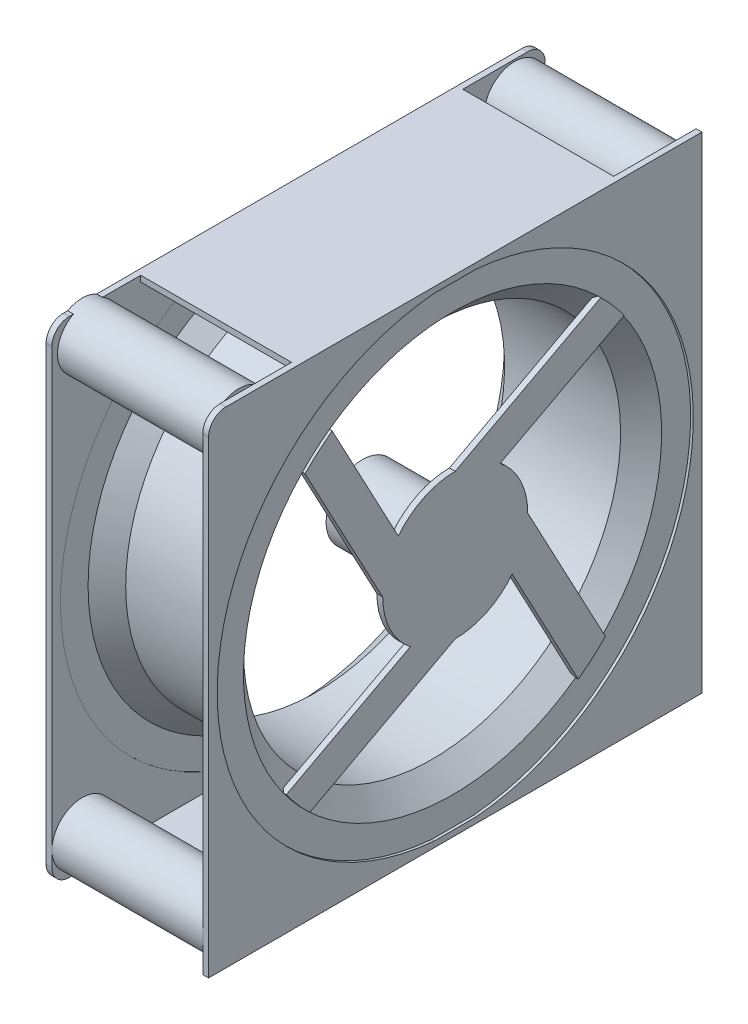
ISO-10303-21;
HEADER;
FILE_DESCRIPTION(('STEP AP214'),'2;1');
FILE_NAME('part.step','',(''),(''),'','','');
FILE_SCHEMA(('AUTOMOTIVE_DESIGN { 1 0 10303 214 1 1 1 1 }'));
ENDSEC;
DATA;
#1=APPLICATION_CONTEXT('core data for automotive mechanical design processes');
#2=APPLICATION_PROTOCOL_DEFINITION('international standard','automotive_design',2000,#1);
#3=PRODUCT_CONTEXT('',#1,'mechanical');
#4=PRODUCT('Part','Part','',(#3));
#5=PRODUCT_RELATED_PRODUCT_CATEGORY('part','',(#4));
#6=PRODUCT_DEFINITION_FORMATION('','',#4);
#7=PRODUCT_DEFINITION_CONTEXT('part definition',#1,'design');
#8=PRODUCT_DEFINITION('design','',#6,#7);
#9=PRODUCT_DEFINITION_SHAPE('','',#8);
#10=(LENGTH_UNIT() NAMED_UNIT(*) SI_UNIT(.MILLI.,.METRE.));
#11=(NAMED_UNIT(*) PLANE_ANGLE_UNIT() SI_UNIT($,.RADIAN.));
#12=(NAMED_UNIT(*) SI_UNIT($,.STERADIAN.) SOLID_ANGLE_UNIT());
#13=UNCERTAINTY_MEASURE_WITH_UNIT(LENGTH_MEASURE(1.E-05),#10,'distance_accuracy_value','');
#14=(GEOMETRIC_REPRESENTATION_CONTEXT(3) GLOBAL_UNCERTAINTY_ASSIGNED_CONTEXT((#13)) GLOBAL_UNIT_ASSIGNED_CONTEXT((#10,
#11,#12)) REPRESENTATION_CONTEXT('',''));
#15=CARTESIAN_POINT('',(0.,0.,0.));
#16=DIRECTION('',(0.,0.,1.));
#17=DIRECTION('',(1.,0.,0.));
#18=AXIS2_PLACEMENT_3D('',#15,#16,#17);
#19=CARTESIAN_POINT('',(33.02,0.,0.));
#20=DIRECTION('',(1.,0.,0.));
#21=DIRECTION('',(0.,0.,-1.));
#22=AXIS2_PLACEMENT_3D('',#19,#20,#21);
#23=PLANE('',#22);
#24=DIRECTION('',(0.,-1.,0.));
#25=VECTOR('',#24,1.);
#26=CARTESIAN_POINT('',(33.02,106.357881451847,107.979897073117));
#27=LINE('',#26,#25);
#28=CARTESIAN_POINT('',(33.02,98.7378814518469,107.979897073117));
#29=VERTEX_POINT('',#28);
#30=CARTESIAN_POINT('',(33.02,-92.2040361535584,107.979897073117));
#31=VERTEX_POINT('',#30);
#32=EDGE_CURVE('E617',#29,#31,#27,.T.);
#33=ORIENTED_EDGE('',*,*,#32,.F.);
#34=CARTESIAN_POINT('',(33.02,98.7378814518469,100.359897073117));
#35=DIRECTION('',(1.,0.,0.));
#36=DIRECTION('',(0.,0.,-1.));
#37=AXIS2_PLACEMENT_3D('',#34,#35,#36);
#38=CIRCLE('',#37,7.62);
#39=CARTESIAN_POINT('',(33.02,106.357881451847,100.359897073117));
#40=VERTEX_POINT('',#39);
#41=EDGE_CURVE('E43',#29,#40,#38,.F.);
#42=ORIENTED_EDGE('',*,*,#41,.T.);
#43=DIRECTION('',(0.,0.,1.));
#44=VECTOR('',#43,1.);
#45=CARTESIAN_POINT('',(33.02,106.357881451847,107.979897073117));
#46=LINE('',#45,#44);
#47=CARTESIAN_POINT('',(33.02,106.357881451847,98.5788426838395));
#48=VERTEX_POINT('',#47);
#49=EDGE_CURVE('E609',#48,#40,#46,.T.);
#50=ORIENTED_EDGE('',*,*,#49,.F.);
#51=CARTESIAN_POINT('',(33.02,94.6418341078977,92.2040361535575));
#52=DIRECTION('',(1.,0.,0.));
#53=DIRECTION('',(0.,0.,-1.));
#54=AXIS2_PLACEMENT_3D('',#51,#52,#53);
#55=CIRCLE('',#54,13.3380629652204);
#56=CARTESIAN_POINT('',(33.02,106.357881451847,85.8292296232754));
#57=VERTEX_POINT('',#56);
#58=EDGE_CURVE('E531',#57,#48,#55,.F.);
#59=ORIENTED_EDGE('',*,*,#58,.F.);
#60=CARTESIAN_POINT('',(33.02,106.357881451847,69.1318674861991));
#61=VERTEX_POINT('',#60);
#62=EDGE_CURVE('E615',#61,#57,#46,.T.);
#63=ORIENTED_EDGE('',*,*,#62,.F.);
#64=DIRECTION('',(0.,1.,0.));
#65=VECTOR('',#64,1.);
#66=CARTESIAN_POINT('',(33.02,0.,69.1318674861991));
#67=LINE('',#66,#65);
#68=CARTESIAN_POINT('',(33.02,103.817881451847,69.1318674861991));
#69=VERTEX_POINT('',#68);
#70=EDGE_CURVE('E525',#69,#61,#67,.T.);
#71=ORIENTED_EDGE('',*,*,#70,.F.);
#72=DIRECTION('',(0.,0.,1.));
#73=VECTOR('',#72,1.);
#74=CARTESIAN_POINT('',(33.02,103.817881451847,0.));
#75=LINE('',#74,#73);
#76=CARTESIAN_POINT('',(33.02,103.817881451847,9.26249328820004));
#77=VERTEX_POINT('',#76);
#78=EDGE_CURVE('E510',#77,#69,#75,.T.);
#79=ORIENTED_EDGE('',*,*,#78,.F.);
#80=CARTESIAN_POINT('',(33.02,0.,0.));
#81=DIRECTION('',(1.,0.,0.));
#82=DIRECTION('',(0.,0.,-1.));
#83=AXIS2_PLACEMENT_3D('',#80,#81,#82);
#84=CIRCLE('',#83,104.230256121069);
#85=CARTESIAN_POINT('',(33.02,-103.817881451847,9.26249328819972));
#86=VERTEX_POINT('',#85);
#87=EDGE_CURVE('E600',#77,#86,#84,.T.);
#88=ORIENTED_EDGE('',*,*,#87,.T.);
#89=DIRECTION('',(0.,0.,-1.));
#90=VECTOR('',#89,1.);
#91=CARTESIAN_POINT('',(33.02,-103.817881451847,0.));
#92=LINE('',#91,#90);
#93=CARTESIAN_POINT('',(33.02,-103.817881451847,71.9063905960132));
#94=VERTEX_POINT('',#93);
#95=EDGE_CURVE('E456',#94,#86,#92,.T.);
#96=ORIENTED_EDGE('',*,*,#95,.F.);
#97=DIRECTION('',(0.,1.,0.));
#98=VECTOR('',#97,1.);
#99=CARTESIAN_POINT('',(33.02,0.,71.9063905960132));
#100=LINE('',#99,#98);
#101=CARTESIAN_POINT('',(33.02,-106.357881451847,71.9063905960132));
#102=VERTEX_POINT('',#101);
#103=EDGE_CURVE('E413',#102,#94,#100,.T.);
#104=ORIENTED_EDGE('',*,*,#103,.F.);
#105=DIRECTION('',(0.,0.,-1.));
#106=VECTOR('',#105,1.);
#107=CARTESIAN_POINT('',(33.02,-106.357881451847,107.979897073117));
#108=LINE('',#107,#106);
#109=CARTESIAN_POINT('',(33.02,-106.357881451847,107.979897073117));
#110=VERTEX_POINT('',#109);
#111=EDGE_CURVE('E620',#110,#102,#108,.T.);
#112=ORIENTED_EDGE('',*,*,#111,.F.);
#113=EDGE_CURVE('E614',#31,#110,#27,.T.);
#114=ORIENTED_EDGE('',*,*,#113,.F.);
#115=CARTESIAN_POINT('',(33.02,-92.2040361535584,94.6418341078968));
#116=DIRECTION('',(1.,0.,0.));
#117=DIRECTION('',(0.,0.,-1.));
#118=AXIS2_PLACEMENT_3D('',#115,#116,#117);
#119=CIRCLE('',#118,13.3380629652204);
#120=EDGE_CURVE('E538',#31,#31,#119,.F.);
#121=ORIENTED_EDGE('',*,*,#120,.F.);
#122=EDGE_LOOP('',(#33,#42,#50,#59,#63,#71,#79,#88,#96,#104,#112,#114,#121));
#123=FACE_BOUND('',#122,.T.);
#124=ADVANCED_FACE('F35',(#123),#23,.F.);
#125=DIRECTION('',(0.,-1.,0.));
#126=VECTOR('',#125,1.);
#127=CARTESIAN_POINT('',(33.02,0.,-69.1318674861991));
#128=LINE('',#127,#126);
#129=CARTESIAN_POINT('',(33.02,-103.817881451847,-69.1318674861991));
#130=VERTEX_POINT('',#129);
#131=CARTESIAN_POINT('',(33.02,-106.357881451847,-69.1318674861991));
#132=VERTEX_POINT('',#131);
#133=EDGE_CURVE('E471',#130,#132,#128,.T.);
#134=ORIENTED_EDGE('',*,*,#133,.F.);
#135=CARTESIAN_POINT('',(33.02,-103.817881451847,-9.26249328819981));
#136=VERTEX_POINT('',#135);
#137=EDGE_CURVE('E459',#136,#130,#92,.T.);
#138=ORIENTED_EDGE('',*,*,#137,.F.);
#139=CARTESIAN_POINT('',(33.02,103.817881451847,-9.26249328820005));
#140=VERTEX_POINT('',#139);
#141=EDGE_CURVE('E604',#136,#140,#84,.T.);
#142=ORIENTED_EDGE('',*,*,#141,.T.);
#143=CARTESIAN_POINT('',(33.02,103.817881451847,-71.9063905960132));
#144=VERTEX_POINT('',#143);
#145=EDGE_CURVE('E506',#144,#140,#75,.T.);
#146=ORIENTED_EDGE('',*,*,#145,.F.);
#147=DIRECTION('',(0.,-1.,0.));
#148=VECTOR('',#147,1.);
#149=CARTESIAN_POINT('',(33.02,0.,-71.9063905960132));
#150=LINE('',#149,#148);
#151=CARTESIAN_POINT('',(33.02,106.357881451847,-71.9063905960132));
#152=VERTEX_POINT('',#151);
#153=EDGE_CURVE('E522',#152,#144,#150,.T.);
#154=ORIENTED_EDGE('',*,*,#153,.F.);
#155=CARTESIAN_POINT('',(33.02,106.357881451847,-107.979897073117));
#156=VERTEX_POINT('',#155);
#157=EDGE_CURVE('E611',#156,#152,#46,.T.);
#158=ORIENTED_EDGE('',*,*,#157,.F.);
#159=DIRECTION('',(0.,1.,0.));
#160=VECTOR('',#159,1.);
#161=CARTESIAN_POINT('',(33.02,106.357881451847,-107.979897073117));
#162=LINE('',#161,#160);
#163=CARTESIAN_POINT('',(33.02,92.2040361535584,-107.979897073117));
#164=VERTEX_POINT('',#163);
#165=EDGE_CURVE('E610',#164,#156,#162,.T.);
#166=ORIENTED_EDGE('',*,*,#165,.F.);
#167=CARTESIAN_POINT('',(33.02,92.2040361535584,-94.6418341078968));
#168=DIRECTION('',(1.,0.,0.));
#169=DIRECTION('',(0.,0.,-1.));
#170=AXIS2_PLACEMENT_3D('',#167,#168,#169);
#171=CIRCLE('',#170,13.3380629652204);
#172=EDGE_CURVE('E554',#164,#164,#171,.F.);
#173=ORIENTED_EDGE('',*,*,#172,.F.);
#174=CARTESIAN_POINT('',(33.02,-106.357881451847,-107.979897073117));
#175=VERTEX_POINT('',#174);
#176=EDGE_CURVE('E607',#175,#164,#162,.T.);
#177=ORIENTED_EDGE('',*,*,#176,.F.);
#178=CARTESIAN_POINT('',(33.02,-106.357881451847,-98.5788426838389));
#179=VERTEX_POINT('',#178);
#180=EDGE_CURVE('E619',#179,#175,#108,.T.);
#181=ORIENTED_EDGE('',*,*,#180,.F.);
#182=CARTESIAN_POINT('',(33.02,-94.6418341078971,-92.2040361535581));
#183=DIRECTION('',(1.,0.,0.));
#184=DIRECTION('',(0.,0.,-1.));
#185=AXIS2_PLACEMENT_3D('',#182,#183,#184);
#186=CIRCLE('',#185,13.3380629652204);
#187=CARTESIAN_POINT('',(33.02,-106.357881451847,-85.8292296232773));
#188=VERTEX_POINT('',#187);
#189=EDGE_CURVE('E547',#188,#179,#186,.F.);
#190=ORIENTED_EDGE('',*,*,#189,.F.);
#191=EDGE_CURVE('E624',#132,#188,#108,.T.);
#192=ORIENTED_EDGE('',*,*,#191,.F.);
#193=EDGE_LOOP('',(#134,#138,#142,#146,#154,#158,#166,#173,#177,#181,#190,#192));
#194=FACE_BOUND('',#193,.T.);
#195=ADVANCED_FACE('F965',(#194),#23,.F.);
#196=CARTESIAN_POINT('',(34.3802561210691,0.,-91.5302561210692));
#197=DIRECTION('',(-1.,0.,0.));
#198=DIRECTION('',(0.,0.,1.));
#199=AXIS2_PLACEMENT_3D('',#196,#197,#198);
#200=PLANE('',#199);
#201=CARTESIAN_POINT('',(34.3802561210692,0.,0.));
#202=DIRECTION('',(-1.,0.,0.));
#203=DIRECTION('',(0.,0.,1.));
#204=AXIS2_PLACEMENT_3D('',#201,#202,#203);
#205=CIRCLE('',#204,91.5302561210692);
#206=CARTESIAN_POINT('',(34.3802561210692,65.7442889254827,-63.6826213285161));
#207=VERTEX_POINT('',#206);
#208=CARTESIAN_POINT('',(34.3802561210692,53.8767443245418,-73.9938119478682));
#209=VERTEX_POINT('',#208);
#210=EDGE_CURVE('E1043',#207,#209,#205,.T.);
#211=ORIENTED_EDGE('',*,*,#210,.T.);
#212=CARTESIAN_POINT('',(34.3802561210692,-63.6826213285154,-65.7442889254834));
#213=VERTEX_POINT('',#212);
#214=EDGE_CURVE('E1047',#209,#213,#205,.T.);
#215=ORIENTED_EDGE('',*,*,#214,.T.);
#216=CARTESIAN_POINT('',(34.3802561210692,-73.9938119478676,-53.8767443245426));
#217=VERTEX_POINT('',#216);
#218=EDGE_CURVE('E1154',#213,#217,#205,.T.);
#219=ORIENTED_EDGE('',*,*,#218,.T.);
#220=CARTESIAN_POINT('',(34.3802561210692,-65.7442889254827,63.6826213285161));
#221=VERTEX_POINT('',#220);
#222=EDGE_CURVE('E1048',#217,#221,#205,.T.);
#223=ORIENTED_EDGE('',*,*,#222,.T.);
#224=CARTESIAN_POINT('',(34.3802561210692,-53.8767443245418,73.9938119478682));
#225=VERTEX_POINT('',#224);
#226=EDGE_CURVE('E1232',#221,#225,#205,.T.);
#227=ORIENTED_EDGE('',*,*,#226,.T.);
#228=CARTESIAN_POINT('',(34.3802561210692,63.6826213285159,65.7442889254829));
#229=VERTEX_POINT('',#228);
#230=EDGE_CURVE('E1235',#225,#229,#205,.T.);
#231=ORIENTED_EDGE('',*,*,#230,.T.);
#232=CARTESIAN_POINT('',(34.3802561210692,73.993811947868,53.876744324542));
#233=VERTEX_POINT('',#232);
#234=EDGE_CURVE('E1178',#229,#233,#205,.T.);
#235=ORIENTED_EDGE('',*,*,#234,.T.);
#236=EDGE_CURVE('E1052',#233,#207,#205,.T.);
#237=ORIENTED_EDGE('',*,*,#236,.T.);
#238=EDGE_LOOP('',(#211,#215,#219,#223,#227,#231,#235,#237));
#239=FACE_BOUND('',#238,.T.);
#240=DIRECTION('',(0.,0.,1.));
#241=VECTOR('',#240,1.);
#242=CARTESIAN_POINT('',(34.3802561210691,-103.817881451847,-91.5302561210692));
#243=LINE('',#242,#241);
#244=CARTESIAN_POINT('',(34.3802561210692,-103.817881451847,-9.26249328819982));
#245=VERTEX_POINT('',#244);
#246=CARTESIAN_POINT('',(34.3802561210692,-103.817881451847,9.26249328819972));
#247=VERTEX_POINT('',#246);
#248=EDGE_CURVE('E464',#245,#247,#243,.T.);
#249=ORIENTED_EDGE('',*,*,#248,.F.);
#250=CARTESIAN_POINT('',(34.3802561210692,0.,0.));
#251=DIRECTION('',(-1.,0.,0.));
#252=DIRECTION('',(0.,0.,1.));
#253=AXIS2_PLACEMENT_3D('',#250,#251,#252);
#254=CIRCLE('',#253,104.230256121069);
#255=CARTESIAN_POINT('',(34.3802561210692,103.817881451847,-9.26249328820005));
#256=VERTEX_POINT('',#255);
#257=EDGE_CURVE('E1036',#256,#245,#254,.T.);
#258=ORIENTED_EDGE('',*,*,#257,.F.);
#259=DIRECTION('',(0.,0.,-1.));
#260=VECTOR('',#259,1.);
#261=CARTESIAN_POINT('',(34.3802561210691,103.817881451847,-91.5302561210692));
#262=LINE('',#261,#260);
#263=CARTESIAN_POINT('',(34.3802561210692,103.817881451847,9.26249328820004));
#264=VERTEX_POINT('',#263);
#265=EDGE_CURVE('E516',#264,#256,#262,.T.);
#266=ORIENTED_EDGE('',*,*,#265,.F.);
#267=EDGE_CURVE('E1040',#247,#264,#254,.T.);
#268=ORIENTED_EDGE('',*,*,#267,.F.);
#269=EDGE_LOOP('',(#249,#258,#266,#268));
#270=FACE_BOUND('',#269,.T.);
#271=ADVANCED_FACE('F972',(#239,#270),#200,.F.);
#272=CARTESIAN_POINT('',(33.1102561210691,0.,-91.5302561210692));
#273=DIRECTION('',(-1.,0.,0.));
#274=DIRECTION('',(0.,0.,1.));
#275=AXIS2_PLACEMENT_3D('',#272,#273,#274);
#276=PLANE('',#275);
#277=CARTESIAN_POINT('',(33.1102561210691,0.,0.));
#278=DIRECTION('',(-1.,0.,0.));
#279=DIRECTION('',(0.,0.,1.));
#280=AXIS2_PLACEMENT_3D('',#277,#278,#279);
#281=CIRCLE('',#280,92.056307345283);
#282=CARTESIAN_POINT('',(33.1102561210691,0.,92.056307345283));
#283=VERTEX_POINT('',#282);
#284=EDGE_CURVE('E1060',#283,#283,#281,.T.);
#285=ORIENTED_EDGE('',*,*,#284,.F.);
#286=EDGE_LOOP('',(#285));
#287=FACE_BOUND('',#286,.T.);
#288=CARTESIAN_POINT('',(33.1102561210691,0.,0.));
#289=DIRECTION('',(-1.,0.,0.));
#290=DIRECTION('',(0.,0.,1.));
#291=AXIS2_PLACEMENT_3D('',#288,#289,#290);
#292=CIRCLE('',#291,104.230256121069);
#293=CARTESIAN_POINT('',(33.1102561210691,103.817881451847,-9.26249328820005));
#294=VERTEX_POINT('',#293);
#295=CARTESIAN_POINT('',(33.1102561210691,-103.817881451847,-9.26249328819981));
#296=VERTEX_POINT('',#295);
#297=EDGE_CURVE('E642',#294,#296,#292,.T.);
#298=ORIENTED_EDGE('',*,*,#297,.T.);
#299=DIRECTION('',(0.,0.,1.));
#300=VECTOR('',#299,1.);
#301=CARTESIAN_POINT('',(33.1102561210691,-103.817881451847,-91.5302561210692));
#302=LINE('',#301,#300);
#303=CARTESIAN_POINT('',(33.1102561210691,-103.817881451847,9.26249328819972));
#304=VERTEX_POINT('',#303);
#305=EDGE_CURVE('E439',#296,#304,#302,.T.);
#306=ORIENTED_EDGE('',*,*,#305,.T.);
#307=CARTESIAN_POINT('',(33.1102561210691,103.817881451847,9.26249328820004));
#308=VERTEX_POINT('',#307);
#309=EDGE_CURVE('E637',#304,#308,#292,.T.);
#310=ORIENTED_EDGE('',*,*,#309,.T.);
#311=DIRECTION('',(0.,0.,-1.));
#312=VECTOR('',#311,1.);
#313=CARTESIAN_POINT('',(33.1102561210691,103.817881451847,-91.5302561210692));
#314=LINE('',#313,#312);
#315=EDGE_CURVE('E503',#308,#294,#314,.T.);
#316=ORIENTED_EDGE('',*,*,#315,.T.);
#317=EDGE_LOOP('',(#298,#306,#310,#316));
#318=FACE_BOUND('',#317,.T.);
#319=ADVANCED_FACE('F1238',(#287,#318),#276,.T.);
#320=CARTESIAN_POINT('',(33.02,0.,0.));
#321=DIRECTION('',(1.,0.,0.));
#322=DIRECTION('',(0.,0.,-1.));
#323=AXIS2_PLACEMENT_3D('',#320,#321,#322);
#324=CYLINDRICAL_SURFACE('',#323,104.230256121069);
#325=DIRECTION('',(1.,0.,0.));
#326=VECTOR('',#325,1.);
#327=CARTESIAN_POINT('',(33.02,-103.817881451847,-9.26249328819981));
#328=LINE('',#327,#326);
#329=CARTESIAN_POINT('',(35.56,-103.817881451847,-9.26249328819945));
#330=VERTEX_POINT('',#329);
#331=EDGE_CURVE('E467',#330,#245,#328,.F.);
#332=ORIENTED_EDGE('',*,*,#331,.F.);
#333=CARTESIAN_POINT('',(35.56,0.,0.));
#334=DIRECTION('',(1.,0.,0.));
#335=DIRECTION('',(0.,0.,-1.));
#336=AXIS2_PLACEMENT_3D('',#333,#334,#335);
#337=CIRCLE('',#336,104.230256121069);
#338=CARTESIAN_POINT('',(35.56,103.817881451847,-9.26249328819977));
#339=VERTEX_POINT('',#338);
#340=EDGE_CURVE('E599',#330,#339,#337,.T.);
#341=ORIENTED_EDGE('',*,*,#340,.T.);
#342=DIRECTION('',(1.,0.,0.));
#343=VECTOR('',#342,1.);
#344=CARTESIAN_POINT('',(33.02,103.817881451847,-9.26249328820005));
#345=LINE('',#344,#343);
#346=EDGE_CURVE('E513',#256,#339,#345,.T.);
#347=ORIENTED_EDGE('',*,*,#346,.F.);
#348=ORIENTED_EDGE('',*,*,#257,.T.);
#349=EDGE_LOOP('',(#332,#341,#347,#348));
#350=FACE_BOUND('',#349,.T.);
#351=ADVANCED_FACE('F976',(#350),#324,.F.);
#352=DIRECTION('',(1.,0.,0.));
#353=VECTOR('',#352,1.);
#354=CARTESIAN_POINT('',(33.02,-103.817881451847,9.26249328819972));
#355=LINE('',#354,#353);
#356=CARTESIAN_POINT('',(35.56,-103.817881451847,9.26249328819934));
#357=VERTEX_POINT('',#356);
#358=EDGE_CURVE('E461',#247,#357,#355,.T.);
#359=ORIENTED_EDGE('',*,*,#358,.F.);
#360=ORIENTED_EDGE('',*,*,#267,.T.);
#361=DIRECTION('',(1.,0.,0.));
#362=VECTOR('',#361,1.);
#363=CARTESIAN_POINT('',(33.02,103.817881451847,9.26249328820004));
#364=LINE('',#363,#362);
#365=CARTESIAN_POINT('',(35.56,103.817881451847,9.26249328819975));
#366=VERTEX_POINT('',#365);
#367=EDGE_CURVE('E519',#366,#264,#364,.F.);
#368=ORIENTED_EDGE('',*,*,#367,.F.);
#369=EDGE_CURVE('E605',#366,#357,#337,.T.);
#370=ORIENTED_EDGE('',*,*,#369,.T.);
#371=EDGE_LOOP('',(#359,#360,#368,#370));
#372=FACE_BOUND('',#371,.T.);
#373=ADVANCED_FACE('F1241',(#372),#324,.F.);
#374=DIRECTION('',(1.,0.,0.));
#375=VECTOR('',#374,1.);
#376=CARTESIAN_POINT('',(33.02,-103.817881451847,-9.26249328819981));
#377=LINE('',#376,#375);
#378=EDGE_CURVE('E458',#296,#136,#377,.F.);
#379=ORIENTED_EDGE('',*,*,#378,.F.);
#380=ORIENTED_EDGE('',*,*,#297,.F.);
#381=DIRECTION('',(1.,0.,0.));
#382=VECTOR('',#381,1.);
#383=CARTESIAN_POINT('',(33.02,103.817881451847,-9.26249328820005));
#384=LINE('',#383,#382);
#385=EDGE_CURVE('E483',#140,#294,#384,.T.);
#386=ORIENTED_EDGE('',*,*,#385,.F.);
#387=ORIENTED_EDGE('',*,*,#141,.F.);
#388=EDGE_LOOP('',(#379,#380,#386,#387));
#389=FACE_BOUND('',#388,.T.);
#390=ADVANCED_FACE('F1279',(#389),#324,.F.);
#391=DIRECTION('',(1.,0.,0.));
#392=VECTOR('',#391,1.);
#393=CARTESIAN_POINT('',(33.02,-103.817881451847,9.26249328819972));
#394=LINE('',#393,#392);
#395=EDGE_CURVE('E436',#86,#304,#394,.T.);
#396=ORIENTED_EDGE('',*,*,#395,.F.);
#397=ORIENTED_EDGE('',*,*,#87,.F.);
#398=DIRECTION('',(1.,0.,0.));
#399=VECTOR('',#398,1.);
#400=CARTESIAN_POINT('',(33.02,103.817881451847,9.26249328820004));
#401=LINE('',#400,#399);
#402=EDGE_CURVE('E509',#308,#77,#401,.F.);
#403=ORIENTED_EDGE('',*,*,#402,.F.);
#404=ORIENTED_EDGE('',*,*,#309,.F.);
#405=EDGE_LOOP('',(#396,#397,#403,#404));
#406=FACE_BOUND('',#405,.T.);
#407=ADVANCED_FACE('F1275',(#406),#324,.F.);
#408=CARTESIAN_POINT('',(-33.02,0.,0.));
#409=DIRECTION('',(-1.,0.,0.));
#410=DIRECTION('',(0.,0.,1.));
#411=AXIS2_PLACEMENT_3D('',#408,#409,#410);
#412=PLANE('',#411);
#413=DIRECTION('',(0.,1.,0.));
#414=VECTOR('',#413,1.);
#415=CARTESIAN_POINT('',(-33.02,106.357881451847,-107.979897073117));
#416=LINE('',#415,#414);
#417=CARTESIAN_POINT('',(-33.02,92.2040361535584,-107.979897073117));
#418=VERTEX_POINT('',#417);
#419=CARTESIAN_POINT('',(-33.02,98.7378814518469,-107.979897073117));
#420=VERTEX_POINT('',#419);
#421=EDGE_CURVE('E574',#418,#420,#416,.T.);
#422=ORIENTED_EDGE('',*,*,#421,.T.);
#423=CARTESIAN_POINT('',(-33.02,98.7378814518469,-100.359897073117));
#424=DIRECTION('',(-1.,0.,0.));
#425=DIRECTION('',(0.,0.,1.));
#426=AXIS2_PLACEMENT_3D('',#423,#424,#425);
#427=CIRCLE('',#426,7.62);
#428=CARTESIAN_POINT('',(-33.02,106.357881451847,-100.359897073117));
#429=VERTEX_POINT('',#428);
#430=EDGE_CURVE('E922',#420,#429,#427,.F.);
#431=ORIENTED_EDGE('',*,*,#430,.T.);
#432=DIRECTION('',(0.,0.,1.));
#433=VECTOR('',#432,1.);
#434=CARTESIAN_POINT('',(-33.02,106.357881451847,-107.979897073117));
#435=LINE('',#434,#433);
#436=CARTESIAN_POINT('',(-33.0200000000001,106.357881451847,-71.9063905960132));
#437=VERTEX_POINT('',#436);
#438=EDGE_CURVE('E579',#429,#437,#435,.T.);
#439=ORIENTED_EDGE('',*,*,#438,.T.);
#440=DIRECTION('',(0.,-1.,0.));
#441=VECTOR('',#440,1.);
#442=CARTESIAN_POINT('',(-33.02,106.357881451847,-71.9063905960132));
#443=LINE('',#442,#441);
#444=CARTESIAN_POINT('',(-33.0200000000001,103.817881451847,-71.9063905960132));
#445=VERTEX_POINT('',#444);
#446=EDGE_CURVE('E480',#437,#445,#443,.T.);
#447=ORIENTED_EDGE('',*,*,#446,.T.);
#448=DIRECTION('',(0.,0.,1.));
#449=VECTOR('',#448,1.);
#450=CARTESIAN_POINT('',(-33.02,103.817881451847,-71.9063905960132));
#451=LINE('',#450,#449);
#452=CARTESIAN_POINT('',(-33.02,103.817881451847,-9.26249328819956));
#453=VERTEX_POINT('',#452);
#454=EDGE_CURVE('E487',#445,#453,#451,.T.);
#455=ORIENTED_EDGE('',*,*,#454,.T.);
#456=CARTESIAN_POINT('',(-33.02,0.,0.));
#457=DIRECTION('',(1.,0.,0.));
#458=DIRECTION('',(0.,0.,-1.));
#459=AXIS2_PLACEMENT_3D('',#456,#457,#458);
#460=CIRCLE('',#459,104.230256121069);
#461=CARTESIAN_POINT('',(-33.02,-103.817881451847,-9.2624932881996));
#462=VERTEX_POINT('',#461);
#463=EDGE_CURVE('E566',#462,#453,#460,.T.);
#464=ORIENTED_EDGE('',*,*,#463,.F.);
#465=DIRECTION('',(0.,0.,-1.));
#466=VECTOR('',#465,1.);
#467=CARTESIAN_POINT('',(-33.02,-103.817881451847,71.9063905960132));
#468=LINE('',#467,#466);
#469=CARTESIAN_POINT('',(-33.02,-103.817881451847,-69.1318674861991));
#470=VERTEX_POINT('',#469);
#471=EDGE_CURVE('E431',#462,#470,#468,.T.);
#472=ORIENTED_EDGE('',*,*,#471,.T.);
#473=DIRECTION('',(0.,-1.,0.));
#474=VECTOR('',#473,1.);
#475=CARTESIAN_POINT('',(-33.02,-103.817881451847,-69.1318674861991));
#476=LINE('',#475,#474);
#477=CARTESIAN_POINT('',(-33.0200000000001,-106.357881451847,-69.1318674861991));
#478=VERTEX_POINT('',#477);
#479=EDGE_CURVE('E429',#470,#478,#476,.T.);
#480=ORIENTED_EDGE('',*,*,#479,.T.);
#481=DIRECTION('',(0.,0.,-1.));
#482=VECTOR('',#481,1.);
#483=CARTESIAN_POINT('',(-33.02,-106.357881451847,-107.979897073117));
#484=LINE('',#483,#482);
#485=CARTESIAN_POINT('',(-33.02,-106.357881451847,-85.8292296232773));
#486=VERTEX_POINT('',#485);
#487=EDGE_CURVE('E575',#478,#486,#484,.T.);
#488=ORIENTED_EDGE('',*,*,#487,.T.);
#489=CARTESIAN_POINT('',(-33.02,-94.6418341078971,-92.2040361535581));
#490=DIRECTION('',(-1.,0.,0.));
#491=DIRECTION('',(0.,0.,1.));
#492=AXIS2_PLACEMENT_3D('',#489,#490,#491);
#493=CIRCLE('',#492,13.3380629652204);
#494=CARTESIAN_POINT('',(-33.02,-106.357881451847,-98.5788426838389));
#495=VERTEX_POINT('',#494);
#496=EDGE_CURVE('E551',#486,#495,#493,.T.);
#497=ORIENTED_EDGE('',*,*,#496,.T.);
#498=CARTESIAN_POINT('',(-33.02,-106.357881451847,-100.359897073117));
#499=VERTEX_POINT('',#498);
#500=EDGE_CURVE('E571',#495,#499,#484,.T.);
#501=ORIENTED_EDGE('',*,*,#500,.T.);
#502=CARTESIAN_POINT('',(-33.02,-98.7378814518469,-100.359897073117));
#503=DIRECTION('',(-1.,0.,0.));
#504=DIRECTION('',(0.,0.,1.));
#505=AXIS2_PLACEMENT_3D('',#502,#503,#504);
#506=CIRCLE('',#505,7.62);
#507=CARTESIAN_POINT('',(-33.02,-98.7378814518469,-107.979897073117));
#508=VERTEX_POINT('',#507);
#509=EDGE_CURVE('E920',#499,#508,#506,.F.);
#510=ORIENTED_EDGE('',*,*,#509,.T.);
#511=EDGE_CURVE('E576',#508,#418,#416,.T.);
#512=ORIENTED_EDGE('',*,*,#511,.T.);
#513=CARTESIAN_POINT('',(-33.02,92.2040361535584,-94.6418341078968));
#514=DIRECTION('',(-1.,0.,0.));
#515=DIRECTION('',(0.,0.,1.));
#516=AXIS2_PLACEMENT_3D('',#513,#514,#515);
#517=CIRCLE('',#516,13.3380629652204);
#518=EDGE_CURVE('E557',#418,#418,#517,.T.);
#519=ORIENTED_EDGE('',*,*,#518,.T.);
#520=EDGE_LOOP('',(#422,#431,#439,#447,#455,#464,#472,#480,#488,#497,#501,#510,#512,#519));
#521=FACE_BOUND('',#520,.T.);
#522=ADVANCED_FACE('F1024',(#521),#412,.F.);
#523=DIRECTION('',(0.,-1.,0.));
#524=VECTOR('',#523,1.);
#525=CARTESIAN_POINT('',(-33.02,106.357881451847,107.979897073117));
#526=LINE('',#525,#524);
#527=CARTESIAN_POINT('',(-33.02,-92.2040361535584,107.979897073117));
#528=VERTEX_POINT('',#527);
#529=CARTESIAN_POINT('',(-33.02,-98.7378814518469,107.979897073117));
#530=VERTEX_POINT('',#529);
#531=EDGE_CURVE('E572',#528,#530,#526,.T.);
#532=ORIENTED_EDGE('',*,*,#531,.T.);
#533=CARTESIAN_POINT('',(-33.02,-98.7378814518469,100.359897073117));
#534=DIRECTION('',(-1.,0.,0.));
#535=DIRECTION('',(0.,0.,1.));
#536=AXIS2_PLACEMENT_3D('',#533,#534,#535);
#537=CIRCLE('',#536,7.62);
#538=CARTESIAN_POINT('',(-33.02,-106.357881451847,100.359897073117));
#539=VERTEX_POINT('',#538);
#540=EDGE_CURVE('E936',#530,#539,#537,.F.);
#541=ORIENTED_EDGE('',*,*,#540,.T.);
#542=CARTESIAN_POINT('',(-33.0200000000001,-106.357881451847,71.9063905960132));
#543=VERTEX_POINT('',#542);
#544=EDGE_CURVE('E435',#539,#543,#484,.T.);
#545=ORIENTED_EDGE('',*,*,#544,.T.);
#546=DIRECTION('',(0.,1.,0.));
#547=VECTOR('',#546,1.);
#548=CARTESIAN_POINT('',(-33.02,-106.357881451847,71.9063905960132));
#549=LINE('',#548,#547);
#550=CARTESIAN_POINT('',(-33.0200000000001,-103.817881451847,71.9063905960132));
#551=VERTEX_POINT('',#550);
#552=EDGE_CURVE('E411',#543,#551,#549,.T.);
#553=ORIENTED_EDGE('',*,*,#552,.T.);
#554=CARTESIAN_POINT('',(-33.02,-103.817881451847,9.26249328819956));
#555=VERTEX_POINT('',#554);
#556=EDGE_CURVE('E421',#551,#555,#468,.T.);
#557=ORIENTED_EDGE('',*,*,#556,.T.);
#558=CARTESIAN_POINT('',(-33.02,103.817881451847,9.2624932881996));
#559=VERTEX_POINT('',#558);
#560=EDGE_CURVE('E565',#559,#555,#460,.T.);
#561=ORIENTED_EDGE('',*,*,#560,.F.);
#562=CARTESIAN_POINT('',(-33.02,103.817881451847,69.1318674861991));
#563=VERTEX_POINT('',#562);
#564=EDGE_CURVE('E478',#559,#563,#451,.T.);
#565=ORIENTED_EDGE('',*,*,#564,.T.);
#566=DIRECTION('',(0.,1.,0.));
#567=VECTOR('',#566,1.);
#568=CARTESIAN_POINT('',(-33.02,103.817881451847,69.1318674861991));
#569=LINE('',#568,#567);
#570=CARTESIAN_POINT('',(-33.0200000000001,106.357881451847,69.1318674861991));
#571=VERTEX_POINT('',#570);
#572=EDGE_CURVE('E484',#563,#571,#569,.T.);
#573=ORIENTED_EDGE('',*,*,#572,.T.);
#574=CARTESIAN_POINT('',(-33.02,106.357881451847,85.8292296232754));
#575=VERTEX_POINT('',#574);
#576=EDGE_CURVE('E582',#571,#575,#435,.T.);
#577=ORIENTED_EDGE('',*,*,#576,.T.);
#578=CARTESIAN_POINT('',(-33.02,94.6418341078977,92.2040361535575));
#579=DIRECTION('',(-1.,0.,0.));
#580=DIRECTION('',(0.,0.,1.));
#581=AXIS2_PLACEMENT_3D('',#578,#579,#580);
#582=CIRCLE('',#581,13.3380629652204);
#583=CARTESIAN_POINT('',(-33.02,106.357881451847,98.5788426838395));
#584=VERTEX_POINT('',#583);
#585=EDGE_CURVE('E535',#575,#584,#582,.T.);
#586=ORIENTED_EDGE('',*,*,#585,.T.);
#587=CARTESIAN_POINT('',(-33.02,106.357881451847,100.359897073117));
#588=VERTEX_POINT('',#587);
#589=EDGE_CURVE('E578',#584,#588,#435,.T.);
#590=ORIENTED_EDGE('',*,*,#589,.T.);
#591=CARTESIAN_POINT('',(-33.02,98.7378814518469,100.359897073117));
#592=DIRECTION('',(-1.,0.,0.));
#593=DIRECTION('',(0.,0.,1.));
#594=AXIS2_PLACEMENT_3D('',#591,#592,#593);
#595=CIRCLE('',#594,7.62);
#596=CARTESIAN_POINT('',(-33.02,98.7378814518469,107.979897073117));
#597=VERTEX_POINT('',#596);
#598=EDGE_CURVE('E934',#588,#597,#595,.F.);
#599=ORIENTED_EDGE('',*,*,#598,.T.);
#600=EDGE_CURVE('E569',#597,#528,#526,.T.);
#601=ORIENTED_EDGE('',*,*,#600,.T.);
#602=CARTESIAN_POINT('',(-33.02,-92.2040361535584,94.6418341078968));
#603=DIRECTION('',(-1.,0.,0.));
#604=DIRECTION('',(0.,0.,1.));
#605=AXIS2_PLACEMENT_3D('',#602,#603,#604);
#606=CIRCLE('',#605,13.3380629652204);
#607=EDGE_CURVE('E541',#528,#528,#606,.T.);
#608=ORIENTED_EDGE('',*,*,#607,.T.);
#609=EDGE_LOOP('',(#532,#541,#545,#553,#557,#561,#565,#573,#577,#586,#590,#599,#601,#608));
#610=FACE_BOUND('',#609,.T.);
#611=ADVANCED_FACE('F433',(#610),#412,.F.);
#612=CARTESIAN_POINT('',(-33.02,106.357881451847,-107.979897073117));
#613=DIRECTION('',(0.,-1.,0.));
#614=DIRECTION('',(0.,0.,-1.));
#615=AXIS2_PLACEMENT_3D('',#612,#613,#614);
#616=PLANE('',#615);
#617=DIRECTION('',(0.,0.,1.));
#618=VECTOR('',#617,1.);
#619=CARTESIAN_POINT('',(-35.56,106.357881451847,-107.979897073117));
#620=LINE('',#619,#618);
#621=CARTESIAN_POINT('',(-35.56,106.357881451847,98.5788426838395));
#622=VERTEX_POINT('',#621);
#623=CARTESIAN_POINT('',(-35.56,106.357881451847,100.359897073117));
#624=VERTEX_POINT('',#623);
#625=EDGE_CURVE('E591',#622,#624,#620,.T.);
#626=ORIENTED_EDGE('',*,*,#625,.T.);
#627=DIRECTION('',(-1.,0.,0.));
#628=VECTOR('',#627,1.);
#629=CARTESIAN_POINT('',(-33.02,106.357881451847,100.359897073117));
#630=LINE('',#629,#628);
#631=EDGE_CURVE('E11',#624,#588,#630,.F.);
#632=ORIENTED_EDGE('',*,*,#631,.T.);
#633=ORIENTED_EDGE('',*,*,#589,.F.);
#634=DIRECTION('',(-1.,0.,0.));
#635=VECTOR('',#634,1.);
#636=CARTESIAN_POINT('',(70.745739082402,106.357881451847,98.5788426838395));
#637=LINE('',#636,#635);
#638=EDGE_CURVE('E874',#584,#622,#637,.T.);
#639=ORIENTED_EDGE('',*,*,#638,.T.);
#640=EDGE_LOOP('',(#626,#632,#633,#639));
#641=FACE_BOUND('',#640,.T.);
#642=ADVANCED_FACE('F1318',(#641),#616,.F.);
#643=CARTESIAN_POINT('',(-33.02,-106.357881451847,-107.979897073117));
#644=DIRECTION('',(0.,1.,0.));
#645=DIRECTION('',(0.,0.,1.));
#646=AXIS2_PLACEMENT_3D('',#643,#644,#645);
#647=PLANE('',#646);
#648=DIRECTION('',(0.,0.,-1.));
#649=VECTOR('',#648,1.);
#650=CARTESIAN_POINT('',(-35.56,-106.357881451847,-107.979897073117));
#651=LINE('',#650,#649);
#652=CARTESIAN_POINT('',(-35.56,-106.357881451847,-98.5788426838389));
#653=VERTEX_POINT('',#652);
#654=CARTESIAN_POINT('',(-35.56,-106.357881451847,-100.359897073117));
#655=VERTEX_POINT('',#654);
#656=EDGE_CURVE('E585',#653,#655,#651,.T.);
#657=ORIENTED_EDGE('',*,*,#656,.T.);
#658=DIRECTION('',(-1.,0.,0.));
#659=VECTOR('',#658,1.);
#660=CARTESIAN_POINT('',(-33.02,-106.357881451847,-100.359897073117));
#661=LINE('',#660,#659);
#662=EDGE_CURVE('E924',#655,#499,#661,.F.);
#663=ORIENTED_EDGE('',*,*,#662,.T.);
#664=ORIENTED_EDGE('',*,*,#500,.F.);
#665=DIRECTION('',(-1.,0.,0.));
#666=VECTOR('',#665,1.);
#667=CARTESIAN_POINT('',(70.745739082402,-106.357881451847,-98.5788426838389));
#668=LINE('',#667,#666);
#669=EDGE_CURVE('E868',#495,#653,#668,.T.);
#670=ORIENTED_EDGE('',*,*,#669,.T.);
#671=EDGE_LOOP('',(#657,#663,#664,#670));
#672=FACE_BOUND('',#671,.T.);
#673=ADVANCED_FACE('F818',(#672),#647,.F.);
#674=CARTESIAN_POINT('',(33.02,0.,0.));
#675=DIRECTION('',(1.,0.,0.));
#676=DIRECTION('',(0.,0.,-1.));
#677=AXIS2_PLACEMENT_3D('',#674,#675,#676);
#678=PLANE('',#677);
#679=CARTESIAN_POINT('',(33.02,65.7442889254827,-63.6826213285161));
#680=CARTESIAN_POINT('',(33.02,31.75,0.));
#681=B_SPLINE_CURVE_WITH_KNOTS('',1,(#679,#680),.UNSPECIFIED.,.F.,.F.,(2,2),(0.,1.),.UNSPECIFIED.);
#682=CARTESIAN_POINT('',(33.02,65.0709225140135,-62.4211818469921));
#683=VERTEX_POINT('',#682);
#684=CARTESIAN_POINT('',(33.02,31.75,0.));
#685=VERTEX_POINT('',#684);
#686=EDGE_CURVE('E1085',#683,#685,#681,.T.);
#687=ORIENTED_EDGE('',*,*,#686,.F.);
#688=CARTESIAN_POINT('',(33.02,0.,0.));
#689=DIRECTION('',(1.,0.,0.));
#690=DIRECTION('',(0.,0.,-1.));
#691=AXIS2_PLACEMENT_3D('',#688,#689,#690);
#692=CIRCLE('',#691,90.17);
#693=CARTESIAN_POINT('',(33.02,53.2306401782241,-72.7813701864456));
#694=VERTEX_POINT('',#693);
#695=EDGE_CURVE('E843',#683,#694,#692,.F.);
#696=ORIENTED_EDGE('',*,*,#695,.T.);
#697=CARTESIAN_POINT('',(33.02,24.925880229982,-19.6662908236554));
#698=CARTESIAN_POINT('',(33.02,53.8767443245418,-73.9938119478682));
#699=B_SPLINE_CURVE_WITH_KNOTS('',1,(#697,#698),.UNSPECIFIED.,.F.,.F.,(2,2),(0.,1.),.UNSPECIFIED.);
#700=CARTESIAN_POINT('',(33.02,24.925880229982,-19.6662908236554));
#701=VERTEX_POINT('',#700);
#702=EDGE_CURVE('E1076',#701,#694,#699,.T.);
#703=ORIENTED_EDGE('',*,*,#702,.F.);
#704=CARTESIAN_POINT('',(33.02,0.,0.));
#705=DIRECTION('',(1.,0.,0.));
#706=DIRECTION('',(0.,0.,-1.));
#707=AXIS2_PLACEMENT_3D('',#704,#705,#706);
#708=CIRCLE('',#707,31.75);
#709=CARTESIAN_POINT('',(33.02,3.30619663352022E-13,-31.75));
#710=VERTEX_POINT('',#709);
#711=EDGE_CURVE('E1119',#710,#701,#708,.T.);
#712=ORIENTED_EDGE('',*,*,#711,.F.);
#713=CARTESIAN_POINT('',(33.02,-63.6826213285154,-65.7442889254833));
#714=CARTESIAN_POINT('',(33.02,3.32563790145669E-13,-31.75));
#715=B_SPLINE_CURVE_WITH_KNOTS('',1,(#713,#714),.UNSPECIFIED.,.F.,.F.,(2,2),(0.,1.),.UNSPECIFIED.);
#716=CARTESIAN_POINT('',(33.02,-62.4211818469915,-65.0709225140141));
#717=VERTEX_POINT('',#716);
#718=EDGE_CURVE('E646',#717,#710,#715,.T.);
#719=ORIENTED_EDGE('',*,*,#718,.F.);
#720=CARTESIAN_POINT('',(33.02,0.,0.));
#721=DIRECTION('',(1.,0.,0.));
#722=DIRECTION('',(0.,0.,-1.));
#723=AXIS2_PLACEMENT_3D('',#720,#721,#722);
#724=CIRCLE('',#723,90.17);
#725=CARTESIAN_POINT('',(33.02,-72.781370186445,-53.2306401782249));
#726=VERTEX_POINT('',#725);
#727=EDGE_CURVE('E859',#717,#726,#724,.F.);
#728=ORIENTED_EDGE('',*,*,#727,.T.);
#729=CARTESIAN_POINT('',(33.02,-19.6662908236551,-24.9258802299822));
#730=CARTESIAN_POINT('',(33.02,-73.9938119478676,-53.8767443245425));
#731=B_SPLINE_CURVE_WITH_KNOTS('',1,(#729,#730),.UNSPECIFIED.,.F.,.F.,(2,2),(0.,1.),.UNSPECIFIED.);
#732=CARTESIAN_POINT('',(33.02,-19.6662908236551,-24.9258802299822));
#733=VERTEX_POINT('',#732);
#734=EDGE_CURVE('E650',#733,#726,#731,.T.);
#735=ORIENTED_EDGE('',*,*,#734,.F.);
#736=CARTESIAN_POINT('',(33.02,-31.75,0.));
#737=VERTEX_POINT('',#736);
#738=EDGE_CURVE('E1126',#737,#733,#708,.T.);
#739=ORIENTED_EDGE('',*,*,#738,.F.);
#740=CARTESIAN_POINT('',(33.02,-65.7442889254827,63.6826213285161));
#741=CARTESIAN_POINT('',(33.02,-31.75,0.));
#742=B_SPLINE_CURVE_WITH_KNOTS('',1,(#740,#741),.UNSPECIFIED.,.F.,.F.,(2,2),(0.,1.),.UNSPECIFIED.);
#743=CARTESIAN_POINT('',(33.02,-65.0709225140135,62.4211818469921));
#744=VERTEX_POINT('',#743);
#745=EDGE_CURVE('E1143',#744,#737,#742,.T.);
#746=ORIENTED_EDGE('',*,*,#745,.F.);
#747=CARTESIAN_POINT('',(33.02,0.,0.));
#748=DIRECTION('',(1.,0.,0.));
#749=DIRECTION('',(0.,0.,-1.));
#750=AXIS2_PLACEMENT_3D('',#747,#748,#749);
#751=CIRCLE('',#750,90.17);
#752=CARTESIAN_POINT('',(33.02,-53.2306401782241,72.7813701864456));
#753=VERTEX_POINT('',#752);
#754=EDGE_CURVE('E850',#744,#753,#751,.F.);
#755=ORIENTED_EDGE('',*,*,#754,.T.);
#756=CARTESIAN_POINT('',(33.02,-24.925880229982,19.6662908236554));
#757=CARTESIAN_POINT('',(33.02,-53.8767443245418,73.9938119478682));
#758=B_SPLINE_CURVE_WITH_KNOTS('',1,(#756,#757),.UNSPECIFIED.,.F.,.F.,(2,2),(0.,1.),.UNSPECIFIED.);
#759=CARTESIAN_POINT('',(33.02,-24.925880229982,19.6662908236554));
#760=VERTEX_POINT('',#759);
#761=EDGE_CURVE('E1195',#760,#753,#758,.T.);
#762=ORIENTED_EDGE('',*,*,#761,.F.);
#763=CARTESIAN_POINT('',(33.02,-1.08910469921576E-13,31.75));
#764=VERTEX_POINT('',#763);
#765=EDGE_CURVE('E1123',#764,#760,#708,.T.);
#766=ORIENTED_EDGE('',*,*,#765,.F.);
#767=CARTESIAN_POINT('',(33.02,63.6826213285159,65.7442889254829));
#768=CARTESIAN_POINT('',(33.02,-1.10854596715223E-13,31.75));
#769=B_SPLINE_CURVE_WITH_KNOTS('',1,(#767,#768),.UNSPECIFIED.,.F.,.F.,(2,2),(0.,1.),.UNSPECIFIED.);
#770=CARTESIAN_POINT('',(33.02,62.4211818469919,65.0709225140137));
#771=VERTEX_POINT('',#770);
#772=EDGE_CURVE('E741',#771,#764,#769,.T.);
#773=ORIENTED_EDGE('',*,*,#772,.F.);
#774=CARTESIAN_POINT('',(33.02,0.,0.));
#775=DIRECTION('',(1.,0.,0.));
#776=DIRECTION('',(0.,0.,-1.));
#777=AXIS2_PLACEMENT_3D('',#774,#775,#776);
#778=CIRCLE('',#777,90.17);
#779=CARTESIAN_POINT('',(33.02,72.7813701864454,53.2306401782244));
#780=VERTEX_POINT('',#779);
#781=EDGE_CURVE('E776',#771,#780,#778,.F.);
#782=ORIENTED_EDGE('',*,*,#781,.T.);
#783=CARTESIAN_POINT('',(33.02,19.6662908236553,24.9258802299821));
#784=CARTESIAN_POINT('',(33.02,73.993811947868,53.876744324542));
#785=B_SPLINE_CURVE_WITH_KNOTS('',1,(#783,#784),.UNSPECIFIED.,.F.,.F.,(2,2),(0.,1.),.UNSPECIFIED.);
#786=CARTESIAN_POINT('',(33.02,19.6662908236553,24.9258802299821));
#787=VERTEX_POINT('',#786);
#788=EDGE_CURVE('E745',#787,#780,#785,.T.);
#789=ORIENTED_EDGE('',*,*,#788,.F.);
#790=EDGE_CURVE('E1099',#685,#787,#708,.T.);
#791=ORIENTED_EDGE('',*,*,#790,.F.);
#792=EDGE_LOOP('',(#687,#696,#703,#712,#719,#728,#735,#739,#746,#755,#762,#766,#773,#782,#789,#791));
#793=FACE_BOUND('',#792,.T.);
#794=CARTESIAN_POINT('',(33.02,0.,0.));
#795=DIRECTION('',(1.,0.,0.));
#796=DIRECTION('',(0.,0.,-1.));
#797=AXIS2_PLACEMENT_3D('',#794,#795,#796);
#798=CIRCLE('',#797,15.875);
#799=CARTESIAN_POINT('',(33.02,0.,-15.875));
#800=VERTEX_POINT('',#799);
#801=EDGE_CURVE('E862',#800,#800,#798,.F.);
#802=ORIENTED_EDGE('',*,*,#801,.F.);
#803=EDGE_LOOP('',(#802));
#804=FACE_BOUND('',#803,.T.);
#805=ADVANCED_FACE('F815',(#793,#804),#678,.F.);
#806=CARTESIAN_POINT('',(33.02,0.,0.));
#807=DIRECTION('',(1.,0.,0.));
#808=DIRECTION('',(0.,0.,-1.));
#809=AXIS2_PLACEMENT_3D('',#806,#807,#808);
#810=CYLINDRICAL_SURFACE('',#809,31.75);
#811=DIRECTION('',(1.,0.,0.));
#812=VECTOR('',#811,1.);
#813=CARTESIAN_POINT('',(33.02,3.30619663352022E-13,-31.75));
#814=LINE('',#813,#812);
#815=CARTESIAN_POINT('',(35.56,0.,-31.75));
#816=VERTEX_POINT('',#815);
#817=EDGE_CURVE('E659',#710,#816,#814,.T.);
#818=ORIENTED_EDGE('',*,*,#817,.F.);
#819=ORIENTED_EDGE('',*,*,#711,.T.);
#820=DIRECTION('',(1.,0.,0.));
#821=VECTOR('',#820,1.);
#822=CARTESIAN_POINT('',(33.02,24.925880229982,-19.6662908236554));
#823=LINE('',#822,#821);
#824=CARTESIAN_POINT('',(35.56,24.925880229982,-19.6662908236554));
#825=VERTEX_POINT('',#824);
#826=EDGE_CURVE('E1075',#701,#825,#823,.T.);
#827=ORIENTED_EDGE('',*,*,#826,.T.);
#828=CARTESIAN_POINT('',(35.56,0.,0.));
#829=DIRECTION('',(1.,0.,0.));
#830=DIRECTION('',(0.,0.,-1.));
#831=AXIS2_PLACEMENT_3D('',#828,#829,#830);
#832=CIRCLE('',#831,31.75);
#833=EDGE_CURVE('E1121',#816,#825,#832,.T.);
#834=ORIENTED_EDGE('',*,*,#833,.F.);
#835=EDGE_LOOP('',(#818,#819,#827,#834));
#836=FACE_BOUND('',#835,.T.);
#837=ADVANCED_FACE('F813',(#836),#810,.T.);
#838=DIRECTION('',(1.,0.,0.));
#839=VECTOR('',#838,1.);
#840=CARTESIAN_POINT('',(33.02,-19.6662908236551,-24.9258802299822));
#841=LINE('',#840,#839);
#842=CARTESIAN_POINT('',(35.56,-19.6662908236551,-24.9258802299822));
#843=VERTEX_POINT('',#842);
#844=EDGE_CURVE('E684',#733,#843,#841,.T.);
#845=ORIENTED_EDGE('',*,*,#844,.T.);
#846=CARTESIAN_POINT('',(35.56,-31.75,0.));
#847=VERTEX_POINT('',#846);
#848=EDGE_CURVE('E1148',#847,#843,#832,.T.);
#849=ORIENTED_EDGE('',*,*,#848,.F.);
#850=DIRECTION('',(1.,0.,0.));
#851=VECTOR('',#850,1.);
#852=CARTESIAN_POINT('',(33.02,-31.75,0.));
#853=LINE('',#852,#851);
#854=EDGE_CURVE('E739',#737,#847,#853,.T.);
#855=ORIENTED_EDGE('',*,*,#854,.F.);
#856=ORIENTED_EDGE('',*,*,#738,.T.);
#857=EDGE_LOOP('',(#845,#849,#855,#856));
#858=FACE_BOUND('',#857,.T.);
#859=ADVANCED_FACE('F1135',(#858),#810,.T.);
#860=DIRECTION('',(1.,0.,0.));
#861=VECTOR('',#860,1.);
#862=CARTESIAN_POINT('',(33.02,-24.925880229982,19.6662908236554));
#863=LINE('',#862,#861);
#864=CARTESIAN_POINT('',(35.56,-24.925880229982,19.6662908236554));
#865=VERTEX_POINT('',#864);
#866=EDGE_CURVE('E1190',#760,#865,#863,.T.);
#867=ORIENTED_EDGE('',*,*,#866,.T.);
#868=CARTESIAN_POINT('',(35.56,-1.42247325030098E-13,31.75));
#869=VERTEX_POINT('',#868);
#870=EDGE_CURVE('E1120',#869,#865,#832,.T.);
#871=ORIENTED_EDGE('',*,*,#870,.F.);
#872=DIRECTION('',(1.,0.,0.));
#873=VECTOR('',#872,1.);
#874=CARTESIAN_POINT('',(33.02,-1.08910469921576E-13,31.75));
#875=LINE('',#874,#873);
#876=EDGE_CURVE('E754',#764,#869,#875,.T.);
#877=ORIENTED_EDGE('',*,*,#876,.F.);
#878=ORIENTED_EDGE('',*,*,#765,.T.);
#879=EDGE_LOOP('',(#867,#871,#877,#878));
#880=FACE_BOUND('',#879,.T.);
#881=ADVANCED_FACE('F814',(#880),#810,.T.);
#882=CARTESIAN_POINT('',(-34.3802561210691,0.,0.));
#883=DIRECTION('',(-1.,0.,0.));
#884=DIRECTION('',(0.,0.,1.));
#885=AXIS2_PLACEMENT_3D('',#882,#883,#884);
#886=CONICAL_SURFACE('',#885,91.5302561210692,0.78539816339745);
#887=CARTESIAN_POINT('',(-25.4,0.,0.));
#888=DIRECTION('',(-1.,0.,0.));
#889=DIRECTION('',(0.,0.,1.));
#890=AXIS2_PLACEMENT_3D('',#887,#888,#889);
#891=CIRCLE('',#890,82.55);
#892=CARTESIAN_POINT('',(-25.4,0.,82.55));
#893=VERTEX_POINT('',#892);
#894=EDGE_CURVE('E1053',#893,#893,#891,.T.);
#895=ORIENTED_EDGE('',*,*,#894,.F.);
#896=EDGE_LOOP('',(#895));
#897=FACE_BOUND('',#896,.T.);
#898=CARTESIAN_POINT('',(-34.3802561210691,0.,0.));
#899=DIRECTION('',(-1.,0.,0.));
#900=DIRECTION('',(0.,0.,1.));
#901=AXIS2_PLACEMENT_3D('',#898,#899,#900);
#902=CIRCLE('',#901,91.5302561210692);
#903=CARTESIAN_POINT('',(-34.3802561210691,0.,91.5302561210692));
#904=VERTEX_POINT('',#903);
#905=EDGE_CURVE('E1039',#904,#904,#902,.T.);
#906=ORIENTED_EDGE('',*,*,#905,.T.);
#907=EDGE_LOOP('',(#906));
#908=FACE_BOUND('',#907,.T.);
#909=ADVANCED_FACE('F1681',(#897,#908),#886,.F.);
#910=CARTESIAN_POINT('',(-34.3802561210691,0.,-91.5302561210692));
#911=DIRECTION('',(1.,0.,0.));
#912=DIRECTION('',(0.,0.,-1.));
#913=AXIS2_PLACEMENT_3D('',#910,#911,#912);
#914=PLANE('',#913);
#915=ORIENTED_EDGE('',*,*,#905,.F.);
#916=EDGE_LOOP('',(#915));
#917=FACE_BOUND('',#916,.T.);
#918=CARTESIAN_POINT('',(-34.3802561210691,0.,0.));
#919=DIRECTION('',(1.,0.,0.));
#920=DIRECTION('',(0.,0.,-1.));
#921=AXIS2_PLACEMENT_3D('',#918,#919,#920);
#922=CIRCLE('',#921,104.230256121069);
#923=CARTESIAN_POINT('',(-34.3802561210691,0.,-104.230256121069));
#924=VERTEX_POINT('',#923);
#925=EDGE_CURVE('E581',#924,#924,#922,.F.);
#926=ORIENTED_EDGE('',*,*,#925,.T.);
#927=EDGE_LOOP('',(#926));
#928=FACE_BOUND('',#927,.T.);
#929=ADVANCED_FACE('F1669',(#917,#928),#914,.F.);
#930=CARTESIAN_POINT('',(25.4,0.,0.));
#931=DIRECTION('',(1.,0.,0.));
#932=DIRECTION('',(0.,0.,-1.));
#933=AXIS2_PLACEMENT_3D('',#930,#931,#932);
#934=CONICAL_SURFACE('',#933,82.55,0.78539816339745);
#935=ORIENTED_EDGE('',*,*,#727,.F.);
#936=CARTESIAN_POINT('',(33.0198,-62.4209962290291,-65.0708234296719));
#937=CARTESIAN_POINT('',(33.2464823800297,-62.6313765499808,-65.1831261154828));
#938=CARTESIAN_POINT('',(33.4732115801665,-62.8417175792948,-65.2954078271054));
#939=CARTESIAN_POINT('',(33.9267636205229,-63.2623210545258,-65.5199293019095));
#940=CARTESIAN_POINT('',(34.1535864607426,-63.4725835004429,-65.6321690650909));
#941=CARTESIAN_POINT('',(34.3804561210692,-63.6828066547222,-65.7443878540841));
#942=B_SPLINE_CURVE_WITH_KNOTS('',3,(#936,#937,#938,#939,#940,#941),.UNSPECIFIED.,.F.,.F.,(4,2,
4),(0.,0.987071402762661,1.97414280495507),.UNSPECIFIED.);
#943=EDGE_CURVE('E695',#717,#213,#942,.T.);
#944=ORIENTED_EDGE('',*,*,#943,.T.);
#945=ORIENTED_EDGE('',*,*,#214,.F.);
#946=CARTESIAN_POINT('',(34.3804561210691,53.8768393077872,-73.993990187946));
#947=CARTESIAN_POINT('',(34.1536628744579,53.7691316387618,-73.7918721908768));
#948=CARTESIAN_POINT('',(33.9268782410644,53.6614199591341,-73.5897466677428));
#949=CARTESIAN_POINT('',(33.473326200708,53.445988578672,-73.1854805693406));
#950=CARTESIAN_POINT('',(33.2465587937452,53.3382688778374,-72.9833399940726));
#951=CARTESIAN_POINT('',(33.0198,53.2305451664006,-72.7811918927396));
#952=B_SPLINE_CURVE_WITH_KNOTS('',3,(#946,#947,#948,#949,#950,#951),.UNSPECIFIED.,.F.,.F.,(4,2,
4),(0.,0.966948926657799,1.93389785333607),.UNSPECIFIED.);
#953=EDGE_CURVE('E836',#209,#694,#952,.T.);
#954=ORIENTED_EDGE('',*,*,#953,.T.);
#955=ORIENTED_EDGE('',*,*,#695,.F.);
#956=CARTESIAN_POINT('',(33.0198,65.0708234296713,-62.4209962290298));
#957=CARTESIAN_POINT('',(33.2464823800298,65.1831261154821,-62.6313765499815));
#958=CARTESIAN_POINT('',(33.4732115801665,65.2954078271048,-62.8417175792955));
#959=CARTESIAN_POINT('',(33.9267636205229,65.5199293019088,-63.2623210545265));
#960=CARTESIAN_POINT('',(34.1535864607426,65.6321690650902,-63.4725835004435));
#961=CARTESIAN_POINT('',(34.3804561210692,65.7443878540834,-63.6828066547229));
#962=B_SPLINE_CURVE_WITH_KNOTS('',3,(#956,#957,#958,#959,#960,#961),.UNSPECIFIED.,.F.,.F.,(4,2,
4),(0.,0.987071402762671,1.97414280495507),.UNSPECIFIED.);
#963=EDGE_CURVE('E842',#683,#207,#962,.T.);
#964=ORIENTED_EDGE('',*,*,#963,.T.);
#965=ORIENTED_EDGE('',*,*,#236,.F.);
#966=CARTESIAN_POINT('',(34.3804561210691,73.9939901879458,53.8768393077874));
#967=CARTESIAN_POINT('',(34.1536628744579,73.7918721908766,53.769131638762));
#968=CARTESIAN_POINT('',(33.9268782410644,73.5897466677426,53.6614199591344));
#969=CARTESIAN_POINT('',(33.473326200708,73.1854805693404,53.4459885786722));
#970=CARTESIAN_POINT('',(33.2465587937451,72.9833399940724,53.3382688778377));
#971=CARTESIAN_POINT('',(33.0198,72.7811918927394,53.2305451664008));
#972=B_SPLINE_CURVE_WITH_KNOTS('',3,(#966,#967,#968,#969,#970,#971),.UNSPECIFIED.,.F.,.F.,(4,2,
4),(0.,0.966948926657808,1.93389785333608),.UNSPECIFIED.);
#973=EDGE_CURVE('E786',#233,#780,#972,.T.);
#974=ORIENTED_EDGE('',*,*,#973,.T.);
#975=ORIENTED_EDGE('',*,*,#781,.F.);
#976=CARTESIAN_POINT('',(33.0198,62.4209962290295,65.0708234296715));
#977=CARTESIAN_POINT('',(33.2464823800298,62.6313765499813,65.1831261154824));
#978=CARTESIAN_POINT('',(33.4732115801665,62.8417175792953,65.295407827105));
#979=CARTESIAN_POINT('',(33.9267636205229,63.2623210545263,65.519929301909));
#980=CARTESIAN_POINT('',(34.1535864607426,63.4725835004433,65.6321690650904));
#981=CARTESIAN_POINT('',(34.3804561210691,63.6828066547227,65.7443878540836));
#982=B_SPLINE_CURVE_WITH_KNOTS('',3,(#976,#977,#978,#979,#980,#981),.UNSPECIFIED.,.F.,.F.,(4,2,
4),(0.,0.987071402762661,1.97414280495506),.UNSPECIFIED.);
#983=EDGE_CURVE('E792',#771,#229,#982,.T.);
#984=ORIENTED_EDGE('',*,*,#983,.T.);
#985=ORIENTED_EDGE('',*,*,#230,.F.);
#986=CARTESIAN_POINT('',(34.3804561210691,-53.8768393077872,73.993990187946));
#987=CARTESIAN_POINT('',(34.1536628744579,-53.7691316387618,73.7918721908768));
#988=CARTESIAN_POINT('',(33.9268782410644,-53.6614199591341,73.5897466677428));
#989=CARTESIAN_POINT('',(33.473326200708,-53.445988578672,73.1854805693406));
#990=CARTESIAN_POINT('',(33.2465587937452,-53.3382688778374,72.9833399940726));
#991=CARTESIAN_POINT('',(33.0198,-53.2305451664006,72.7811918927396));
#992=B_SPLINE_CURVE_WITH_KNOTS('',3,(#986,#987,#988,#989,#990,#991),.UNSPECIFIED.,.F.,.F.,(4,2,
4),(0.,0.966948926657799,1.93389785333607),.UNSPECIFIED.);
#993=EDGE_CURVE('E731',#225,#753,#992,.T.);
#994=ORIENTED_EDGE('',*,*,#993,.T.);
#995=ORIENTED_EDGE('',*,*,#754,.F.);
#996=CARTESIAN_POINT('',(33.0198,-65.0708234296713,62.4209962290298));
#997=CARTESIAN_POINT('',(33.2464823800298,-65.1831261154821,62.6313765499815));
#998=CARTESIAN_POINT('',(33.4732115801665,-65.2954078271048,62.8417175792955));
#999=CARTESIAN_POINT('',(33.9267636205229,-65.5199293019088,63.2623210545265));
#1000=CARTESIAN_POINT('',(34.1535864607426,-65.6321690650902,63.4725835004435));
#1001=CARTESIAN_POINT('',(34.3804561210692,-65.7443878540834,63.6828066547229));
#1002=B_SPLINE_CURVE_WITH_KNOTS('',3,(#996,#997,#998,#999,#1000,#1001),.UNSPECIFIED.,.F.,.F.,(4,
2,4),(0.,0.987071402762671,1.97414280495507),.UNSPECIFIED.);
#1003=EDGE_CURVE('E853',#744,#221,#1002,.T.);
#1004=ORIENTED_EDGE('',*,*,#1003,.T.);
#1005=ORIENTED_EDGE('',*,*,#222,.F.);
#1006=CARTESIAN_POINT('',(34.3804561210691,-73.9939901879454,-53.8768393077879));
#1007=CARTESIAN_POINT('',(34.1536628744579,-73.7918721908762,-53.7691316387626));
#1008=CARTESIAN_POINT('',(33.9268782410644,-73.5897466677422,-53.6614199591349));
#1009=CARTESIAN_POINT('',(33.473326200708,-73.1854805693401,-53.4459885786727));
#1010=CARTESIAN_POINT('',(33.2465587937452,-72.983339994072,-53.3382688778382));
#1011=CARTESIAN_POINT('',(33.0198,-72.7811918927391,-53.2305451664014));
#1012=B_SPLINE_CURVE_WITH_KNOTS('',3,(#1006,#1007,#1008,#1009,#1010,#1011),.UNSPECIFIED.,.F.,
.F.,(4,2,4),(0.,0.966948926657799,1.93389785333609),.UNSPECIFIED.);
#1013=EDGE_CURVE('E681',#217,#726,#1012,.T.);
#1014=ORIENTED_EDGE('',*,*,#1013,.T.);
#1015=EDGE_LOOP('',(#935,#944,#945,#954,#955,#964,#965,#974,#975,#984,#985,#994,#995,#1004,
#1005,#1014));
#1016=FACE_BOUND('',#1015,.T.);
#1017=CARTESIAN_POINT('',(25.4,0.,0.));
#1018=DIRECTION('',(-1.,0.,0.));
#1019=DIRECTION('',(0.,0.,1.));
#1020=AXIS2_PLACEMENT_3D('',#1017,#1018,#1019);
#1021=CIRCLE('',#1020,82.55);
#1022=CARTESIAN_POINT('',(25.4,0.,82.55));
#1023=VERTEX_POINT('',#1022);
#1024=EDGE_CURVE('E1049',#1023,#1023,#1021,.T.);
#1025=ORIENTED_EDGE('',*,*,#1024,.T.);
#1026=EDGE_LOOP('',(#1025));
#1027=FACE_BOUND('',#1026,.T.);
#1028=ADVANCED_FACE('F701',(#1016,#1027),#934,.F.);
#1029=CARTESIAN_POINT('',(-63.909916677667,0.,0.));
#1030=DIRECTION('',(-1.,0.,0.));
#1031=DIRECTION('',(0.,0.,1.));
#1032=AXIS2_PLACEMENT_3D('',#1029,#1030,#1031);
#1033=CYLINDRICAL_SURFACE('',#1032,82.55);
#1034=ORIENTED_EDGE('',*,*,#1024,.F.);
#1035=EDGE_LOOP('',(#1034));
#1036=FACE_BOUND('',#1035,.T.);
#1037=ORIENTED_EDGE('',*,*,#894,.T.);
#1038=EDGE_LOOP('',(#1037));
#1039=FACE_BOUND('',#1038,.T.);
#1040=ADVANCED_FACE('F1668',(#1036,#1039),#1033,.F.);
#1041=CARTESIAN_POINT('',(-33.4822305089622,0.,0.));
#1042=DIRECTION('',(-1.,0.,0.));
#1043=DIRECTION('',(0.,0.,1.));
#1044=AXIS2_PLACEMENT_3D('',#1041,#1042,#1043);
#1045=CONICAL_SURFACE('',#1044,92.4282817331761,0.78539816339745);
#1046=CARTESIAN_POINT('',(-24.8739487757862,0.,0.));
#1047=DIRECTION('',(-1.,0.,0.));
#1048=DIRECTION('',(0.,0.,1.));
#1049=AXIS2_PLACEMENT_3D('',#1046,#1047,#1048);
#1050=CIRCLE('',#1049,83.82);
#1051=CARTESIAN_POINT('',(-24.8739487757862,0.,83.82));
#1052=VERTEX_POINT('',#1051);
#1053=EDGE_CURVE('E1066',#1052,#1052,#1050,.T.);
#1054=ORIENTED_EDGE('',*,*,#1053,.T.);
#1055=EDGE_LOOP('',(#1054));
#1056=FACE_BOUND('',#1055,.T.);
#1057=CARTESIAN_POINT('',(-33.1102561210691,0.,0.));
#1058=DIRECTION('',(1.,0.,0.));
#1059=DIRECTION('',(0.,0.,-1.));
#1060=AXIS2_PLACEMENT_3D('',#1057,#1058,#1059);
#1061=CIRCLE('',#1060,92.056307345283);
#1062=CARTESIAN_POINT('',(-33.1102561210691,0.,-92.056307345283));
#1063=VERTEX_POINT('',#1062);
#1064=EDGE_CURVE('E1056',#1063,#1063,#1061,.F.);
#1065=ORIENTED_EDGE('',*,*,#1064,.F.);
#1066=EDGE_LOOP('',(#1065));
#1067=FACE_BOUND('',#1066,.T.);
#1068=ADVANCED_FACE('F1742',(#1056,#1067),#1045,.T.);
#1069=CARTESIAN_POINT('',(-33.1102561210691,0.,-91.5302561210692));
#1070=DIRECTION('',(1.,0.,0.));
#1071=DIRECTION('',(0.,0.,-1.));
#1072=AXIS2_PLACEMENT_3D('',#1069,#1070,#1071);
#1073=PLANE('',#1072);
#1074=ORIENTED_EDGE('',*,*,#1064,.T.);
#1075=EDGE_LOOP('',(#1074));
#1076=FACE_BOUND('',#1075,.T.);
#1077=CARTESIAN_POINT('',(-33.1102561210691,0.,0.));
#1078=DIRECTION('',(1.,0.,0.));
#1079=DIRECTION('',(0.,0.,-1.));
#1080=AXIS2_PLACEMENT_3D('',#1077,#1078,#1079);
#1081=CIRCLE('',#1080,104.230256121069);
#1082=CARTESIAN_POINT('',(-33.1102561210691,0.,-104.230256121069));
#1083=VERTEX_POINT('',#1082);
#1084=EDGE_CURVE('E1057',#1083,#1083,#1081,.F.);
#1085=ORIENTED_EDGE('',*,*,#1084,.F.);
#1086=EDGE_LOOP('',(#1085));
#1087=FACE_BOUND('',#1086,.T.);
#1088=ADVANCED_FACE('F1732',(#1076,#1087),#1073,.T.);
#1089=CARTESIAN_POINT('',(24.5019743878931,0.,0.));
#1090=DIRECTION('',(1.,0.,0.));
#1091=DIRECTION('',(0.,0.,-1.));
#1092=AXIS2_PLACEMENT_3D('',#1089,#1090,#1091);
#1093=CONICAL_SURFACE('',#1092,83.4480256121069,0.78539816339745);
#1094=ORIENTED_EDGE('',*,*,#284,.T.);
#1095=EDGE_LOOP('',(#1094));
#1096=FACE_BOUND('',#1095,.T.);
#1097=CARTESIAN_POINT('',(24.8739487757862,0.,0.));
#1098=DIRECTION('',(1.,0.,0.));
#1099=DIRECTION('',(0.,0.,-1.));
#1100=AXIS2_PLACEMENT_3D('',#1097,#1098,#1099);
#1101=CIRCLE('',#1100,83.82);
#1102=CARTESIAN_POINT('',(24.8739487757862,0.,-83.82));
#1103=VERTEX_POINT('',#1102);
#1104=EDGE_CURVE('E1063',#1103,#1103,#1101,.F.);
#1105=ORIENTED_EDGE('',*,*,#1104,.F.);
#1106=EDGE_LOOP('',(#1105));
#1107=FACE_BOUND('',#1106,.T.);
#1108=ADVANCED_FACE('F1722',(#1096,#1107),#1093,.T.);
#1109=CARTESIAN_POINT('',(-63.909916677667,0.,0.));
#1110=DIRECTION('',(-1.,0.,0.));
#1111=DIRECTION('',(0.,0.,1.));
#1112=AXIS2_PLACEMENT_3D('',#1109,#1110,#1111);
#1113=CYLINDRICAL_SURFACE('',#1112,83.82);
#1114=ORIENTED_EDGE('',*,*,#1104,.T.);
#1115=EDGE_LOOP('',(#1114));
#1116=FACE_BOUND('',#1115,.T.);
#1117=ORIENTED_EDGE('',*,*,#1053,.F.);
#1118=EDGE_LOOP('',(#1117));
#1119=FACE_BOUND('',#1118,.T.);
#1120=ADVANCED_FACE('F1715',(#1116,#1119),#1113,.T.);
#1121=CARTESIAN_POINT('',(33.02,65.7442889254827,-63.6826213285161));
#1122=DIRECTION('',(0.,0.882179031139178,0.470914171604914));
#1123=DIRECTION('',(0.,-0.470914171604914,0.882179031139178));
#1124=AXIS2_PLACEMENT_3D('',#1121,#1122,#1123);
#1125=PLANE('',#1124);
#1126=ORIENTED_EDGE('',*,*,#963,.F.);
#1127=ORIENTED_EDGE('',*,*,#686,.T.);
#1128=DIRECTION('',(1.,0.,0.));
#1129=VECTOR('',#1128,1.);
#1130=CARTESIAN_POINT('',(33.02,31.75,0.));
#1131=LINE('',#1130,#1129);
#1132=CARTESIAN_POINT('',(35.56,31.75,0.));
#1133=VERTEX_POINT('',#1132);
#1134=EDGE_CURVE('E1072',#685,#1133,#1131,.T.);
#1135=ORIENTED_EDGE('',*,*,#1134,.T.);
#1136=CARTESIAN_POINT('',(35.56,65.7442889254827,-63.6826213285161));
#1137=CARTESIAN_POINT('',(35.56,31.75,0.));
#1138=B_SPLINE_CURVE_WITH_KNOTS('',1,(#1136,#1137),.UNSPECIFIED.,.F.,.F.,(2,2),(0.,1.),.UNSPECIFIED.);
#1139=CARTESIAN_POINT('',(35.56,65.7442889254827,-63.6826213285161));
#1140=VERTEX_POINT('',#1139);
#1141=EDGE_CURVE('E1091',#1140,#1133,#1138,.T.);
#1142=ORIENTED_EDGE('',*,*,#1141,.F.);
#1143=DIRECTION('',(1.,0.,0.));
#1144=VECTOR('',#1143,1.);
#1145=CARTESIAN_POINT('',(33.02,65.7442889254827,-63.6826213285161));
#1146=LINE('',#1145,#1144);
#1147=EDGE_CURVE('E1071',#207,#1140,#1146,.T.);
#1148=ORIENTED_EDGE('',*,*,#1147,.F.);
#1149=EDGE_LOOP('',(#1126,#1127,#1135,#1142,#1148));
#1150=FACE_BOUND('',#1149,.T.);
#1151=ADVANCED_FACE('F827',(#1150),#1125,.T.);
#1152=CARTESIAN_POINT('',(33.02,0.,0.));
#1153=DIRECTION('',(1.,0.,0.));
#1154=DIRECTION('',(0.,0.,-1.));
#1155=AXIS2_PLACEMENT_3D('',#1152,#1153,#1154);
#1156=CYLINDRICAL_SURFACE('',#1155,91.5302561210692);
#1157=ORIENTED_EDGE('',*,*,#210,.F.);
#1158=ORIENTED_EDGE('',*,*,#1147,.T.);
#1159=CARTESIAN_POINT('',(35.56,0.,0.));
#1160=DIRECTION('',(1.,0.,0.));
#1161=DIRECTION('',(0.,0.,-1.));
#1162=AXIS2_PLACEMENT_3D('',#1159,#1160,#1161);
#1163=CIRCLE('',#1162,91.5302561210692);
#1164=CARTESIAN_POINT('',(35.56,53.8767443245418,-73.9938119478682));
#1165=VERTEX_POINT('',#1164);
#1166=EDGE_CURVE('E1082',#1165,#1140,#1163,.T.);
#1167=ORIENTED_EDGE('',*,*,#1166,.F.);
#1168=DIRECTION('',(1.,0.,0.));
#1169=VECTOR('',#1168,1.);
#1170=CARTESIAN_POINT('',(33.02,53.8767443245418,-73.9938119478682));
#1171=LINE('',#1170,#1169);
#1172=EDGE_CURVE('E1079',#209,#1165,#1171,.T.);
#1173=ORIENTED_EDGE('',*,*,#1172,.F.);
#1174=EDGE_LOOP('',(#1157,#1158,#1167,#1173));
#1175=FACE_BOUND('',#1174,.T.);
#1176=ADVANCED_FACE('F824',(#1175),#1156,.T.);
#1177=CARTESIAN_POINT('',(33.02,24.925880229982,-19.6662908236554));
#1178=DIRECTION('',(0.,-0.882513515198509,-0.470287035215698));
#1179=DIRECTION('',(0.,0.470287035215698,-0.882513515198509));
#1180=AXIS2_PLACEMENT_3D('',#1177,#1178,#1179);
#1181=PLANE('',#1180);
#1182=ORIENTED_EDGE('',*,*,#953,.F.);
#1183=ORIENTED_EDGE('',*,*,#1172,.T.);
#1184=CARTESIAN_POINT('',(35.56,24.925880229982,-19.6662908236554));
#1185=CARTESIAN_POINT('',(35.56,53.8767443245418,-73.9938119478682));
#1186=B_SPLINE_CURVE_WITH_KNOTS('',1,(#1184,#1185),.UNSPECIFIED.,.F.,.F.,(2,2),(0.,1.),.UNSPECIFIED.);
#1187=EDGE_CURVE('E1086',#825,#1165,#1186,.T.);
#1188=ORIENTED_EDGE('',*,*,#1187,.F.);
#1189=ORIENTED_EDGE('',*,*,#826,.F.);
#1190=ORIENTED_EDGE('',*,*,#702,.T.);
#1191=EDGE_LOOP('',(#1182,#1183,#1188,#1189,#1190));
#1192=FACE_BOUND('',#1191,.T.);
#1193=ADVANCED_FACE('F822',(#1192),#1181,.T.);
#1194=CARTESIAN_POINT('',(35.56,0.,0.));
#1195=DIRECTION('',(1.,0.,0.));
#1196=DIRECTION('',(0.,0.,-1.));
#1197=AXIS2_PLACEMENT_3D('',#1194,#1195,#1196);
#1198=PLANE('',#1197);
#1199=ORIENTED_EDGE('',*,*,#1141,.T.);
#1200=CARTESIAN_POINT('',(35.56,19.6662908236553,24.9258802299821));
#1201=VERTEX_POINT('',#1200);
#1202=EDGE_CURVE('E1114',#1133,#1201,#832,.T.);
#1203=ORIENTED_EDGE('',*,*,#1202,.T.);
#1204=CARTESIAN_POINT('',(35.56,19.6662908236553,24.9258802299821));
#1205=CARTESIAN_POINT('',(35.56,73.993811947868,53.876744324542));
#1206=B_SPLINE_CURVE_WITH_KNOTS('',1,(#1204,#1205),.UNSPECIFIED.,.F.,.F.,(2,2),(0.,1.),.UNSPECIFIED.);
#1207=CARTESIAN_POINT('',(35.56,73.993811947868,53.876744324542));
#1208=VERTEX_POINT('',#1207);
#1209=EDGE_CURVE('E761',#1201,#1208,#1206,.T.);
#1210=ORIENTED_EDGE('',*,*,#1209,.T.);
#1211=CARTESIAN_POINT('',(35.56,0.,0.));
#1212=DIRECTION('',(1.,0.,0.));
#1213=DIRECTION('',(0.,1.,0.));
#1214=AXIS2_PLACEMENT_3D('',#1211,#1212,#1213);
#1215=CIRCLE('',#1214,91.5302561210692);
#1216=CARTESIAN_POINT('',(35.56,63.6826213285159,65.7442889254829));
#1217=VERTEX_POINT('',#1216);
#1218=EDGE_CURVE('E746',#1208,#1217,#1215,.T.);
#1219=ORIENTED_EDGE('',*,*,#1218,.T.);
#1220=CARTESIAN_POINT('',(35.56,63.6826213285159,65.7442889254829));
#1221=CARTESIAN_POINT('',(35.56,-1.10854596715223E-13,31.75));
#1222=B_SPLINE_CURVE_WITH_KNOTS('',1,(#1220,#1221),.UNSPECIFIED.,.F.,.F.,(2,2),(0.,1.),.UNSPECIFIED.);
#1223=EDGE_CURVE('E737',#1217,#869,#1222,.T.);
#1224=ORIENTED_EDGE('',*,*,#1223,.T.);
#1225=ORIENTED_EDGE('',*,*,#870,.T.);
#1226=CARTESIAN_POINT('',(35.56,-24.925880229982,19.6662908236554));
#1227=CARTESIAN_POINT('',(35.56,-53.8767443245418,73.9938119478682));
#1228=B_SPLINE_CURVE_WITH_KNOTS('',1,(#1226,#1227),.UNSPECIFIED.,.F.,.F.,(2,2),(0.,1.),.UNSPECIFIED.);
#1229=CARTESIAN_POINT('',(35.56,-53.8767443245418,73.9938119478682));
#1230=VERTEX_POINT('',#1229);
#1231=EDGE_CURVE('E1185',#865,#1230,#1228,.T.);
#1232=ORIENTED_EDGE('',*,*,#1231,.T.);
#1233=CARTESIAN_POINT('',(35.56,0.,0.));
#1234=DIRECTION('',(1.,0.,0.));
#1235=DIRECTION('',(0.,0.,1.));
#1236=AXIS2_PLACEMENT_3D('',#1233,#1234,#1235);
#1237=CIRCLE('',#1236,91.5302561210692);
#1238=CARTESIAN_POINT('',(35.56,-65.7442889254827,63.6826213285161));
#1239=VERTEX_POINT('',#1238);
#1240=EDGE_CURVE('E1198',#1230,#1239,#1237,.T.);
#1241=ORIENTED_EDGE('',*,*,#1240,.T.);
#1242=CARTESIAN_POINT('',(35.56,-65.7442889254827,63.6826213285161));
#1243=CARTESIAN_POINT('',(35.56,-31.75,0.));
#1244=B_SPLINE_CURVE_WITH_KNOTS('',1,(#1242,#1243),.UNSPECIFIED.,.F.,.F.,(2,2),(0.,1.),.UNSPECIFIED.);
#1245=EDGE_CURVE('E1203',#1239,#847,#1244,.T.);
#1246=ORIENTED_EDGE('',*,*,#1245,.T.);
#1247=ORIENTED_EDGE('',*,*,#848,.T.);
#1248=CARTESIAN_POINT('',(35.56,-19.6662908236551,-24.9258802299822));
#1249=CARTESIAN_POINT('',(35.56,-73.9938119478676,-53.8767443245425));
#1250=B_SPLINE_CURVE_WITH_KNOTS('',1,(#1248,#1249),.UNSPECIFIED.,.F.,.F.,(2,2),(0.,1.),.UNSPECIFIED.);
#1251=CARTESIAN_POINT('',(35.56,-73.9938119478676,-53.8767443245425));
#1252=VERTEX_POINT('',#1251);
#1253=EDGE_CURVE('E666',#843,#1252,#1250,.T.);
#1254=ORIENTED_EDGE('',*,*,#1253,.T.);
#1255=CARTESIAN_POINT('',(35.56,0.,0.));
#1256=DIRECTION('',(1.,0.,0.));
#1257=DIRECTION('',(0.,-1.,0.));
#1258=AXIS2_PLACEMENT_3D('',#1255,#1256,#1257);
#1259=CIRCLE('',#1258,91.5302561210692);
#1260=CARTESIAN_POINT('',(35.56,-63.6826213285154,-65.7442889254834));
#1261=VERTEX_POINT('',#1260);
#1262=EDGE_CURVE('E651',#1252,#1261,#1259,.T.);
#1263=ORIENTED_EDGE('',*,*,#1262,.T.);
#1264=CARTESIAN_POINT('',(35.56,-63.6826213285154,-65.7442889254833));
#1265=CARTESIAN_POINT('',(35.56,3.32563790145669E-13,-31.75));
#1266=B_SPLINE_CURVE_WITH_KNOTS('',1,(#1264,#1265),.UNSPECIFIED.,.F.,.F.,(2,2),(0.,1.),.UNSPECIFIED.);
#1267=EDGE_CURVE('E645',#1261,#816,#1266,.T.);
#1268=ORIENTED_EDGE('',*,*,#1267,.T.);
#1269=ORIENTED_EDGE('',*,*,#833,.T.);
#1270=ORIENTED_EDGE('',*,*,#1187,.T.);
#1271=ORIENTED_EDGE('',*,*,#1166,.T.);
#1272=EDGE_LOOP('',(#1199,#1203,#1210,#1219,#1224,#1225,#1232,#1241,#1246,#1247,#1254,#1263,
#1268,#1269,#1270,#1271));
#1273=FACE_BOUND('',#1272,.T.);
#1274=ADVANCED_FACE('F811',(#1273),#1198,.T.);
#1275=DIRECTION('',(1.,0.,0.));
#1276=VECTOR('',#1275,1.);
#1277=CARTESIAN_POINT('',(33.02,19.6662908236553,24.9258802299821));
#1278=LINE('',#1277,#1276);
#1279=EDGE_CURVE('E779',#787,#1201,#1278,.T.);
#1280=ORIENTED_EDGE('',*,*,#1279,.T.);
#1281=ORIENTED_EDGE('',*,*,#1202,.F.);
#1282=ORIENTED_EDGE('',*,*,#1134,.F.);
#1283=ORIENTED_EDGE('',*,*,#790,.T.);
#1284=EDGE_LOOP('',(#1280,#1281,#1282,#1283));
#1285=FACE_BOUND('',#1284,.T.);
#1286=ADVANCED_FACE('F808',(#1285),#810,.T.);
#1287=CARTESIAN_POINT('',(33.02,0.,0.));
#1288=DIRECTION('',(1.,0.,0.));
#1289=DIRECTION('',(0.,0.,-1.));
#1290=AXIS2_PLACEMENT_3D('',#1287,#1288,#1289);
#1291=CYLINDRICAL_SURFACE('',#1290,91.5302561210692);
#1292=ORIENTED_EDGE('',*,*,#234,.F.);
#1293=DIRECTION('',(1.,0.,0.));
#1294=VECTOR('',#1293,1.);
#1295=CARTESIAN_POINT('',(33.02,63.6826213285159,65.7442889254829));
#1296=LINE('',#1295,#1294);
#1297=EDGE_CURVE('E774',#229,#1217,#1296,.T.);
#1298=ORIENTED_EDGE('',*,*,#1297,.T.);
#1299=ORIENTED_EDGE('',*,*,#1218,.F.);
#1300=DIRECTION('',(1.,0.,0.));
#1301=VECTOR('',#1300,1.);
#1302=CARTESIAN_POINT('',(33.02,73.993811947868,53.876744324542));
#1303=LINE('',#1302,#1301);
#1304=EDGE_CURVE('E777',#233,#1208,#1303,.T.);
#1305=ORIENTED_EDGE('',*,*,#1304,.F.);
#1306=EDGE_LOOP('',(#1292,#1298,#1299,#1305));
#1307=FACE_BOUND('',#1306,.T.);
#1308=ADVANCED_FACE('F803',(#1307),#1291,.T.);
#1309=CARTESIAN_POINT('',(33.02,63.6826213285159,65.7442889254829));
#1310=DIRECTION('',(0.,-0.470914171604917,0.882179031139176));
#1311=DIRECTION('',(0.,-0.882179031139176,-0.470914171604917));
#1312=AXIS2_PLACEMENT_3D('',#1309,#1310,#1311);
#1313=PLANE('',#1312);
#1314=ORIENTED_EDGE('',*,*,#983,.F.);
#1315=ORIENTED_EDGE('',*,*,#772,.T.);
#1316=ORIENTED_EDGE('',*,*,#876,.T.);
#1317=ORIENTED_EDGE('',*,*,#1223,.F.);
#1318=ORIENTED_EDGE('',*,*,#1297,.F.);
#1319=EDGE_LOOP('',(#1314,#1315,#1316,#1317,#1318));
#1320=FACE_BOUND('',#1319,.T.);
#1321=ADVANCED_FACE('F801',(#1320),#1313,.T.);
#1322=CARTESIAN_POINT('',(33.02,19.6662908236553,24.9258802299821));
#1323=DIRECTION('',(0.,0.470287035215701,-0.882513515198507));
#1324=DIRECTION('',(0.,0.882513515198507,0.470287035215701));
#1325=AXIS2_PLACEMENT_3D('',#1322,#1323,#1324);
#1326=PLANE('',#1325);
#1327=ORIENTED_EDGE('',*,*,#973,.F.);
#1328=ORIENTED_EDGE('',*,*,#1304,.T.);
#1329=ORIENTED_EDGE('',*,*,#1209,.F.);
#1330=ORIENTED_EDGE('',*,*,#1279,.F.);
#1331=ORIENTED_EDGE('',*,*,#788,.T.);
#1332=EDGE_LOOP('',(#1327,#1328,#1329,#1330,#1331));
#1333=FACE_BOUND('',#1332,.T.);
#1334=ADVANCED_FACE('F798',(#1333),#1326,.T.);
#1335=CARTESIAN_POINT('',(33.02,-65.7442889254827,63.6826213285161));
#1336=DIRECTION('',(0.,-0.882179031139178,-0.470914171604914));
#1337=DIRECTION('',(0.,0.470914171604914,-0.882179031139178));
#1338=AXIS2_PLACEMENT_3D('',#1335,#1336,#1337);
#1339=PLANE('',#1338);
#1340=ORIENTED_EDGE('',*,*,#1003,.F.);
#1341=ORIENTED_EDGE('',*,*,#745,.T.);
#1342=ORIENTED_EDGE('',*,*,#854,.T.);
#1343=ORIENTED_EDGE('',*,*,#1245,.F.);
#1344=DIRECTION('',(1.,0.,0.));
#1345=VECTOR('',#1344,1.);
#1346=CARTESIAN_POINT('',(33.02,-65.7442889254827,63.6826213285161));
#1347=LINE('',#1346,#1345);
#1348=EDGE_CURVE('E738',#221,#1239,#1347,.T.);
#1349=ORIENTED_EDGE('',*,*,#1348,.F.);
#1350=EDGE_LOOP('',(#1340,#1341,#1342,#1343,#1349));
#1351=FACE_BOUND('',#1350,.T.);
#1352=ADVANCED_FACE('F722',(#1351),#1339,.T.);
#1353=CARTESIAN_POINT('',(33.02,0.,0.));
#1354=DIRECTION('',(1.,0.,0.));
#1355=DIRECTION('',(0.,0.,-1.));
#1356=AXIS2_PLACEMENT_3D('',#1353,#1354,#1355);
#1357=CYLINDRICAL_SURFACE('',#1356,91.5302561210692);
#1358=ORIENTED_EDGE('',*,*,#226,.F.);
#1359=ORIENTED_EDGE('',*,*,#1348,.T.);
#1360=ORIENTED_EDGE('',*,*,#1240,.F.);
#1361=DIRECTION('',(1.,0.,0.));
#1362=VECTOR('',#1361,1.);
#1363=CARTESIAN_POINT('',(33.02,-53.8767443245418,73.9938119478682));
#1364=LINE('',#1363,#1362);
#1365=EDGE_CURVE('E1193',#225,#1230,#1364,.T.);
#1366=ORIENTED_EDGE('',*,*,#1365,.F.);
#1367=EDGE_LOOP('',(#1358,#1359,#1360,#1366));
#1368=FACE_BOUND('',#1367,.T.);
#1369=ADVANCED_FACE('F718',(#1368),#1357,.T.);
#1370=CARTESIAN_POINT('',(33.02,-24.925880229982,19.6662908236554));
#1371=DIRECTION('',(0.,0.882513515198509,0.470287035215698));
#1372=DIRECTION('',(0.,-0.470287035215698,0.882513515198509));
#1373=AXIS2_PLACEMENT_3D('',#1370,#1371,#1372);
#1374=PLANE('',#1373);
#1375=ORIENTED_EDGE('',*,*,#993,.F.);
#1376=ORIENTED_EDGE('',*,*,#1365,.T.);
#1377=ORIENTED_EDGE('',*,*,#1231,.F.);
#1378=ORIENTED_EDGE('',*,*,#866,.F.);
#1379=ORIENTED_EDGE('',*,*,#761,.T.);
#1380=EDGE_LOOP('',(#1375,#1376,#1377,#1378,#1379));
#1381=FACE_BOUND('',#1380,.T.);
#1382=ADVANCED_FACE('F721',(#1381),#1374,.T.);
#1383=CARTESIAN_POINT('',(33.02,0.,0.));
#1384=DIRECTION('',(1.,0.,0.));
#1385=DIRECTION('',(0.,0.,-1.));
#1386=AXIS2_PLACEMENT_3D('',#1383,#1384,#1385);
#1387=CYLINDRICAL_SURFACE('',#1386,91.5302561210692);
#1388=ORIENTED_EDGE('',*,*,#218,.F.);
#1389=DIRECTION('',(1.,0.,0.));
#1390=VECTOR('',#1389,1.);
#1391=CARTESIAN_POINT('',(33.02,-63.6826213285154,-65.7442889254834));
#1392=LINE('',#1391,#1390);
#1393=EDGE_CURVE('E679',#213,#1261,#1392,.T.);
#1394=ORIENTED_EDGE('',*,*,#1393,.T.);
#1395=ORIENTED_EDGE('',*,*,#1262,.F.);
#1396=DIRECTION('',(1.,0.,0.));
#1397=VECTOR('',#1396,1.);
#1398=CARTESIAN_POINT('',(33.02,-73.9938119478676,-53.8767443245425));
#1399=LINE('',#1398,#1397);
#1400=EDGE_CURVE('E682',#217,#1252,#1399,.T.);
#1401=ORIENTED_EDGE('',*,*,#1400,.F.);
#1402=EDGE_LOOP('',(#1388,#1394,#1395,#1401));
#1403=FACE_BOUND('',#1402,.T.);
#1404=ADVANCED_FACE('F712',(#1403),#1387,.T.);
#1405=CARTESIAN_POINT('',(33.02,-63.6826213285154,-65.7442889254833));
#1406=DIRECTION('',(0.,0.470914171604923,-0.882179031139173));
#1407=DIRECTION('',(0.,0.882179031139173,0.470914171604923));
#1408=AXIS2_PLACEMENT_3D('',#1405,#1406,#1407);
#1409=PLANE('',#1408);
#1410=ORIENTED_EDGE('',*,*,#943,.F.);
#1411=ORIENTED_EDGE('',*,*,#718,.T.);
#1412=ORIENTED_EDGE('',*,*,#817,.T.);
#1413=ORIENTED_EDGE('',*,*,#1267,.F.);
#1414=ORIENTED_EDGE('',*,*,#1393,.F.);
#1415=EDGE_LOOP('',(#1410,#1411,#1412,#1413,#1414));
#1416=FACE_BOUND('',#1415,.T.);
#1417=ADVANCED_FACE('F710',(#1416),#1409,.T.);
#1418=CARTESIAN_POINT('',(33.02,-19.6662908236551,-24.9258802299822));
#1419=DIRECTION('',(0.,-0.470287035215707,0.882513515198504));
#1420=DIRECTION('',(0.,-0.882513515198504,-0.470287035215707));
#1421=AXIS2_PLACEMENT_3D('',#1418,#1419,#1420);
#1422=PLANE('',#1421);
#1423=ORIENTED_EDGE('',*,*,#1013,.F.);
#1424=ORIENTED_EDGE('',*,*,#1400,.T.);
#1425=ORIENTED_EDGE('',*,*,#1253,.F.);
#1426=ORIENTED_EDGE('',*,*,#844,.F.);
#1427=ORIENTED_EDGE('',*,*,#734,.T.);
#1428=EDGE_LOOP('',(#1423,#1424,#1425,#1426,#1427));
#1429=FACE_BOUND('',#1428,.T.);
#1430=ADVANCED_FACE('F705',(#1429),#1422,.T.);
#1431=CARTESIAN_POINT('',(33.02,106.357881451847,-107.979897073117));
#1432=DIRECTION('',(0.,0.,-1.));
#1433=DIRECTION('',(-1.,0.,0.));
#1434=AXIS2_PLACEMENT_3D('',#1431,#1432,#1433);
#1435=PLANE('',#1434);
#1436=DIRECTION('',(0.,1.,0.));
#1437=VECTOR('',#1436,1.);
#1438=CARTESIAN_POINT('',(35.56,106.357881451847,-107.979897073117));
#1439=LINE('',#1438,#1437);
#1440=CARTESIAN_POINT('',(35.56,-106.357881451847,-107.979897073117));
#1441=VERTEX_POINT('',#1440);
#1442=CARTESIAN_POINT('',(35.56,106.357881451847,-107.979897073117));
#1443=VERTEX_POINT('',#1442);
#1444=EDGE_CURVE('E603',#1441,#1443,#1439,.T.);
#1445=ORIENTED_EDGE('',*,*,#1444,.F.);
#1446=DIRECTION('',(1.,0.,0.));
#1447=VECTOR('',#1446,1.);
#1448=CARTESIAN_POINT('',(33.02,-106.357881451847,-107.979897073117));
#1449=LINE('',#1448,#1447);
#1450=EDGE_CURVE('E634',#175,#1441,#1449,.T.);
#1451=ORIENTED_EDGE('',*,*,#1450,.F.);
#1452=ORIENTED_EDGE('',*,*,#176,.T.);
#1453=ORIENTED_EDGE('',*,*,#165,.T.);
#1454=DIRECTION('',(1.,0.,0.));
#1455=VECTOR('',#1454,1.);
#1456=CARTESIAN_POINT('',(33.02,106.357881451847,-107.979897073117));
#1457=LINE('',#1456,#1455);
#1458=EDGE_CURVE('E623',#156,#1443,#1457,.T.);
#1459=ORIENTED_EDGE('',*,*,#1458,.T.);
#1460=EDGE_LOOP('',(#1445,#1451,#1452,#1453,#1459));
#1461=FACE_BOUND('',#1460,.T.);
#1462=ADVANCED_FACE('F709',(#1461),#1435,.T.);
#1463=CARTESIAN_POINT('',(33.02,-106.357881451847,107.979897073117));
#1464=DIRECTION('',(0.,-1.,0.));
#1465=DIRECTION('',(0.,0.,-1.));
#1466=AXIS2_PLACEMENT_3D('',#1463,#1464,#1465);
#1467=PLANE('',#1466);
#1468=ORIENTED_EDGE('',*,*,#544,.F.);
#1469=DIRECTION('',(-1.,0.,0.));
#1470=VECTOR('',#1469,1.);
#1471=CARTESIAN_POINT('',(-35.56,-106.357881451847,100.359897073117));
#1472=LINE('',#1471,#1470);
#1473=CARTESIAN_POINT('',(-35.56,-106.357881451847,100.359897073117));
#1474=VERTEX_POINT('',#1473);
#1475=EDGE_CURVE('E926',#539,#1474,#1472,.T.);
#1476=ORIENTED_EDGE('',*,*,#1475,.T.);
#1477=CARTESIAN_POINT('',(-35.56,-106.357881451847,-85.8292296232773));
#1478=VERTEX_POINT('',#1477);
#1479=EDGE_CURVE('E586',#1474,#1478,#651,.T.);
#1480=ORIENTED_EDGE('',*,*,#1479,.T.);
#1481=DIRECTION('',(-1.,0.,0.));
#1482=VECTOR('',#1481,1.);
#1483=CARTESIAN_POINT('',(70.745739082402,-106.357881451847,-85.8292296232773));
#1484=LINE('',#1483,#1482);
#1485=EDGE_CURVE('E865',#1478,#486,#1484,.F.);
#1486=ORIENTED_EDGE('',*,*,#1485,.T.);
#1487=ORIENTED_EDGE('',*,*,#487,.F.);
#1488=DIRECTION('',(1.,0.,0.));
#1489=VECTOR('',#1488,1.);
#1490=CARTESIAN_POINT('',(-174.081128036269,-106.357881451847,-69.1318674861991));
#1491=LINE('',#1490,#1489);
#1492=EDGE_CURVE('E446',#478,#132,#1491,.T.);
#1493=ORIENTED_EDGE('',*,*,#1492,.T.);
#1494=ORIENTED_EDGE('',*,*,#191,.T.);
#1495=EDGE_CURVE('E625',#188,#179,#108,.T.);
#1496=ORIENTED_EDGE('',*,*,#1495,.T.);
#1497=ORIENTED_EDGE('',*,*,#180,.T.);
#1498=ORIENTED_EDGE('',*,*,#1450,.T.);
#1499=DIRECTION('',(0.,0.,-1.));
#1500=VECTOR('',#1499,1.);
#1501=CARTESIAN_POINT('',(35.56,-106.357881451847,107.979897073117));
#1502=LINE('',#1501,#1500);
#1503=CARTESIAN_POINT('',(35.56,-106.357881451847,107.979897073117));
#1504=VERTEX_POINT('',#1503);
#1505=EDGE_CURVE('E632',#1504,#1441,#1502,.T.);
#1506=ORIENTED_EDGE('',*,*,#1505,.F.);
#1507=DIRECTION('',(1.,0.,0.));
#1508=VECTOR('',#1507,1.);
#1509=CARTESIAN_POINT('',(33.02,-106.357881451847,107.979897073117));
#1510=LINE('',#1509,#1508);
#1511=EDGE_CURVE('E638',#110,#1504,#1510,.T.);
#1512=ORIENTED_EDGE('',*,*,#1511,.F.);
#1513=ORIENTED_EDGE('',*,*,#111,.T.);
#1514=DIRECTION('',(1.,0.,0.));
#1515=VECTOR('',#1514,1.);
#1516=CARTESIAN_POINT('',(-174.081128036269,-106.357881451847,71.9063905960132));
#1517=LINE('',#1516,#1515);
#1518=EDGE_CURVE('E417',#543,#102,#1517,.T.);
#1519=ORIENTED_EDGE('',*,*,#1518,.F.);
#1520=EDGE_LOOP('',(#1468,#1476,#1480,#1486,#1487,#1493,#1494,#1496,#1497,#1498,#1506,#1512,
#1513,#1519));
#1521=FACE_BOUND('',#1520,.T.);
#1522=ADVANCED_FACE('F982',(#1521),#1467,.T.);
#1523=CARTESIAN_POINT('',(33.02,106.357881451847,107.979897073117));
#1524=DIRECTION('',(0.,0.,1.));
#1525=DIRECTION('',(1.,0.,0.));
#1526=AXIS2_PLACEMENT_3D('',#1523,#1524,#1525);
#1527=PLANE('',#1526);
#1528=DIRECTION('',(0.,-1.,0.));
#1529=VECTOR('',#1528,1.);
#1530=CARTESIAN_POINT('',(35.56,106.357881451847,107.979897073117));
#1531=LINE('',#1530,#1529);
#1532=CARTESIAN_POINT('',(35.56,98.7378814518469,107.979897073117));
#1533=VERTEX_POINT('',#1532);
#1534=EDGE_CURVE('E630',#1533,#1504,#1531,.T.);
#1535=ORIENTED_EDGE('',*,*,#1534,.F.);
#1536=DIRECTION('',(1.,0.,0.));
#1537=VECTOR('',#1536,1.);
#1538=CARTESIAN_POINT('',(33.02,98.7378814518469,107.979897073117));
#1539=LINE('',#1538,#1537);
#1540=EDGE_CURVE('E50',#1533,#29,#1539,.F.);
#1541=ORIENTED_EDGE('',*,*,#1540,.T.);
#1542=ORIENTED_EDGE('',*,*,#32,.T.);
#1543=ORIENTED_EDGE('',*,*,#113,.T.);
#1544=ORIENTED_EDGE('',*,*,#1511,.T.);
#1545=EDGE_LOOP('',(#1535,#1541,#1542,#1543,#1544));
#1546=FACE_BOUND('',#1545,.T.);
#1547=ADVANCED_FACE('F985',(#1546),#1527,.T.);
#1548=CARTESIAN_POINT('',(33.02,106.357881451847,107.979897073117));
#1549=DIRECTION('',(0.,1.,0.));
#1550=DIRECTION('',(0.,0.,1.));
#1551=AXIS2_PLACEMENT_3D('',#1548,#1549,#1550);
#1552=PLANE('',#1551);
#1553=ORIENTED_EDGE('',*,*,#438,.F.);
#1554=DIRECTION('',(-1.,0.,0.));
#1555=VECTOR('',#1554,1.);
#1556=CARTESIAN_POINT('',(-35.56,106.357881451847,-100.359897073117));
#1557=LINE('',#1556,#1555);
#1558=CARTESIAN_POINT('',(-35.56,106.357881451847,-100.359897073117));
#1559=VERTEX_POINT('',#1558);
#1560=EDGE_CURVE('E904',#429,#1559,#1557,.T.);
#1561=ORIENTED_EDGE('',*,*,#1560,.T.);
#1562=CARTESIAN_POINT('',(-35.56,106.357881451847,85.8292296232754));
#1563=VERTEX_POINT('',#1562);
#1564=EDGE_CURVE('E592',#1559,#1563,#620,.T.);
#1565=ORIENTED_EDGE('',*,*,#1564,.T.);
#1566=DIRECTION('',(-1.,0.,0.));
#1567=VECTOR('',#1566,1.);
#1568=CARTESIAN_POINT('',(70.745739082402,106.357881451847,85.8292296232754));
#1569=LINE('',#1568,#1567);
#1570=EDGE_CURVE('E871',#1563,#575,#1569,.F.);
#1571=ORIENTED_EDGE('',*,*,#1570,.T.);
#1572=ORIENTED_EDGE('',*,*,#576,.F.);
#1573=DIRECTION('',(1.,0.,0.));
#1574=VECTOR('',#1573,1.);
#1575=CARTESIAN_POINT('',(-174.081128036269,106.357881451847,69.1318674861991));
#1576=LINE('',#1575,#1574);
#1577=EDGE_CURVE('E491',#571,#61,#1576,.T.);
#1578=ORIENTED_EDGE('',*,*,#1577,.T.);
#1579=ORIENTED_EDGE('',*,*,#62,.T.);
#1580=EDGE_CURVE('E616',#57,#48,#46,.T.);
#1581=ORIENTED_EDGE('',*,*,#1580,.T.);
#1582=ORIENTED_EDGE('',*,*,#49,.T.);
#1583=DIRECTION('',(1.,0.,0.));
#1584=VECTOR('',#1583,1.);
#1585=CARTESIAN_POINT('',(33.02,106.357881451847,100.359897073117));
#1586=LINE('',#1585,#1584);
#1587=CARTESIAN_POINT('',(35.56,106.357881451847,100.359897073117));
#1588=VERTEX_POINT('',#1587);
#1589=EDGE_CURVE('E901',#40,#1588,#1586,.T.);
#1590=ORIENTED_EDGE('',*,*,#1589,.T.);
#1591=DIRECTION('',(0.,0.,1.));
#1592=VECTOR('',#1591,1.);
#1593=CARTESIAN_POINT('',(35.56,106.357881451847,107.979897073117));
#1594=LINE('',#1593,#1592);
#1595=EDGE_CURVE('E628',#1443,#1588,#1594,.T.);
#1596=ORIENTED_EDGE('',*,*,#1595,.F.);
#1597=ORIENTED_EDGE('',*,*,#1458,.F.);
#1598=ORIENTED_EDGE('',*,*,#157,.T.);
#1599=DIRECTION('',(1.,0.,0.));
#1600=VECTOR('',#1599,1.);
#1601=CARTESIAN_POINT('',(-174.081128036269,106.357881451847,-71.9063905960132));
#1602=LINE('',#1601,#1600);
#1603=EDGE_CURVE('E494',#437,#152,#1602,.T.);
#1604=ORIENTED_EDGE('',*,*,#1603,.F.);
#1605=EDGE_LOOP('',(#1553,#1561,#1565,#1571,#1572,#1578,#1579,#1581,#1582,#1590,#1596,#1597,
#1598,#1604));
#1606=FACE_BOUND('',#1605,.T.);
#1607=ADVANCED_FACE('F950',(#1606),#1552,.T.);
#1608=CARTESIAN_POINT('',(35.56,0.,0.));
#1609=DIRECTION('',(1.,0.,0.));
#1610=DIRECTION('',(0.,0.,-1.));
#1611=AXIS2_PLACEMENT_3D('',#1608,#1609,#1610);
#1612=PLANE('',#1611);
#1613=ORIENTED_EDGE('',*,*,#1595,.T.);
#1614=CARTESIAN_POINT('',(35.56,98.7378814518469,100.359897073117));
#1615=DIRECTION('',(1.,0.,0.));
#1616=DIRECTION('',(0.,0.,-1.));
#1617=AXIS2_PLACEMENT_3D('',#1614,#1615,#1616);
#1618=CIRCLE('',#1617,7.62);
#1619=EDGE_CURVE('E58',#1588,#1533,#1618,.T.);
#1620=ORIENTED_EDGE('',*,*,#1619,.T.);
#1621=ORIENTED_EDGE('',*,*,#1534,.T.);
#1622=ORIENTED_EDGE('',*,*,#1505,.T.);
#1623=ORIENTED_EDGE('',*,*,#1444,.T.);
#1624=EDGE_LOOP('',(#1613,#1620,#1621,#1622,#1623));
#1625=FACE_BOUND('',#1624,.T.);
#1626=ORIENTED_EDGE('',*,*,#340,.F.);
#1627=DIRECTION('',(0.,0.,-1.));
#1628=VECTOR('',#1627,1.);
#1629=CARTESIAN_POINT('',(35.56,-103.817881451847,71.9063905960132));
#1630=LINE('',#1629,#1628);
#1631=EDGE_CURVE('E416',#357,#330,#1630,.T.);
#1632=ORIENTED_EDGE('',*,*,#1631,.F.);
#1633=ORIENTED_EDGE('',*,*,#369,.F.);
#1634=DIRECTION('',(0.,0.,1.));
#1635=VECTOR('',#1634,1.);
#1636=CARTESIAN_POINT('',(35.56,103.817881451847,-71.9063905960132));
#1637=LINE('',#1636,#1635);
#1638=EDGE_CURVE('E475',#339,#366,#1637,.T.);
#1639=ORIENTED_EDGE('',*,*,#1638,.F.);
#1640=EDGE_LOOP('',(#1626,#1632,#1633,#1639));
#1641=FACE_BOUND('',#1640,.T.);
#1642=ADVANCED_FACE('F978',(#1625,#1641),#1612,.T.);
#1643=CARTESIAN_POINT('',(-5.08,0.,0.));
#1644=DIRECTION('',(1.,0.,0.));
#1645=DIRECTION('',(0.,0.,-1.));
#1646=AXIS2_PLACEMENT_3D('',#1643,#1644,#1645);
#1647=CYLINDRICAL_SURFACE('',#1646,15.875);
#1648=CARTESIAN_POINT('',(-5.08,0.,0.));
#1649=DIRECTION('',(-1.,0.,0.));
#1650=DIRECTION('',(0.,0.,1.));
#1651=AXIS2_PLACEMENT_3D('',#1648,#1649,#1650);
#1652=CIRCLE('',#1651,15.875);
#1653=CARTESIAN_POINT('',(-5.08,0.,-15.875));
#1654=VERTEX_POINT('',#1653);
#1655=EDGE_CURVE('E596',#1654,#1654,#1652,.T.);
#1656=CARTESIAN_POINT('',(-5.08,0.,-15.875));
#1657=CARTESIAN_POINT('',(-4.683125,0.,-15.875));
#1658=CARTESIAN_POINT('',(-4.28625,0.,-15.875));
#1659=CARTESIAN_POINT('',(-3.4925,0.,-15.875));
#1660=CARTESIAN_POINT('',(-3.095625,0.,-15.875));
#1661=CARTESIAN_POINT('',(-2.301875,0.,-15.875));
#1662=CARTESIAN_POINT('',(-1.905,0.,-15.875));
#1663=CARTESIAN_POINT('',(-1.11125,0.,-15.875));
#1664=CARTESIAN_POINT('',(-0.714375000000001,0.,-15.875));
#1665=CARTESIAN_POINT('',(0.0793749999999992,0.,-15.875));
#1666=CARTESIAN_POINT('',(0.476249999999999,0.,-15.875));
#1667=CARTESIAN_POINT('',(1.27,0.,-15.875));
#1668=CARTESIAN_POINT('',(1.666875,0.,-15.875));
#1669=CARTESIAN_POINT('',(2.460625,0.,-15.875));
#1670=CARTESIAN_POINT('',(2.8575,0.,-15.875));
#1671=CARTESIAN_POINT('',(3.65125,0.,-15.875));
#1672=CARTESIAN_POINT('',(4.048125,0.,-15.875));
#1673=CARTESIAN_POINT('',(4.841875,0.,-15.875));
#1674=CARTESIAN_POINT('',(5.23875,0.,-15.875));
#1675=CARTESIAN_POINT('',(6.0325,0.,-15.875));
#1676=CARTESIAN_POINT('',(6.429375,0.,-15.875));
#1677=CARTESIAN_POINT('',(7.223125,0.,-15.875));
#1678=CARTESIAN_POINT('',(7.62,0.,-15.875));
#1679=CARTESIAN_POINT('',(8.41375,0.,-15.875));
#1680=CARTESIAN_POINT('',(8.810625,0.,-15.875));
#1681=CARTESIAN_POINT('',(9.604375,0.,-15.875));
#1682=CARTESIAN_POINT('',(10.00125,0.,-15.875));
#1683=CARTESIAN_POINT('',(10.795,0.,-15.875));
#1684=CARTESIAN_POINT('',(11.191875,0.,-15.875));
#1685=CARTESIAN_POINT('',(11.985625,0.,-15.875));
#1686=CARTESIAN_POINT('',(12.3825,0.,-15.875));
#1687=CARTESIAN_POINT('',(13.17625,0.,-15.875));
#1688=CARTESIAN_POINT('',(13.573125,0.,-15.875));
#1689=CARTESIAN_POINT('',(14.366875,0.,-15.875));
#1690=CARTESIAN_POINT('',(14.76375,0.,-15.875));
#1691=CARTESIAN_POINT('',(15.5575,0.,-15.875));
#1692=CARTESIAN_POINT('',(15.954375,0.,-15.875));
#1693=CARTESIAN_POINT('',(16.748125,0.,-15.875));
#1694=CARTESIAN_POINT('',(17.145,0.,-15.875));
#1695=CARTESIAN_POINT('',(17.93875,0.,-15.875));
#1696=CARTESIAN_POINT('',(18.335625,0.,-15.875));
#1697=CARTESIAN_POINT('',(19.129375,0.,-15.875));
#1698=CARTESIAN_POINT('',(19.52625,0.,-15.875));
#1699=CARTESIAN_POINT('',(20.32,0.,-15.875));
#1700=CARTESIAN_POINT('',(20.716875,0.,-15.875));
#1701=CARTESIAN_POINT('',(21.510625,0.,-15.875));
#1702=CARTESIAN_POINT('',(21.9075,0.,-15.875));
#1703=CARTESIAN_POINT('',(22.70125,0.,-15.875));
#1704=CARTESIAN_POINT('',(23.098125,0.,-15.875));
#1705=CARTESIAN_POINT('',(23.891875,0.,-15.875));
#1706=CARTESIAN_POINT('',(24.28875,0.,-15.875));
#1707=CARTESIAN_POINT('',(25.0825,0.,-15.875));
#1708=CARTESIAN_POINT('',(25.479375,0.,-15.875));
#1709=CARTESIAN_POINT('',(26.273125,0.,-15.875));
#1710=CARTESIAN_POINT('',(26.67,0.,-15.875));
#1711=CARTESIAN_POINT('',(27.46375,0.,-15.875));
#1712=CARTESIAN_POINT('',(27.860625,0.,-15.875));
#1713=CARTESIAN_POINT('',(28.654375,0.,-15.875));
#1714=CARTESIAN_POINT('',(29.05125,0.,-15.875));
#1715=CARTESIAN_POINT('',(29.845,0.,-15.875));
#1716=CARTESIAN_POINT('',(30.241875,0.,-15.875));
#1717=CARTESIAN_POINT('',(31.035625,0.,-15.875));
#1718=CARTESIAN_POINT('',(31.4325,0.,-15.875));
#1719=CARTESIAN_POINT('',(32.22625,0.,-15.875));
#1720=CARTESIAN_POINT('',(32.623125,0.,-15.875));
#1721=CARTESIAN_POINT('',(33.02,0.,-15.875));
#1722=B_SPLINE_CURVE_WITH_KNOTS('',3,(#1656,#1657,#1658,#1659,#1660,#1661,#1662,#1663,#1664,
#1665,#1666,#1667,#1668,#1669,#1670,#1671,#1672,#1673,#1674,#1675,#1676,#1677,#1678,#1679,#1680,
#1681,#1682,#1683,#1684,#1685,#1686,#1687,#1688,#1689,#1690,#1691,#1692,#1693,#1694,#1695,#1696,
#1697,#1698,#1699,#1700,#1701,#1702,#1703,#1704,#1705,#1706,#1707,#1708,#1709,#1710,#1711,#1712,
#1713,#1714,#1715,#1716,#1717,#1718,#1719,#1720,#1721),.UNSPECIFIED.,.F.,.F.,(4,2,2,2,2,2,2,2,2,
2,2,2,2,2,2,2,2,2,2,2,2,2,2,2,2,2,2,2,2,2,2,2,4),(0.,1.190625,2.38125,3.571875,4.7625,5.953125,
7.14375,8.334375,9.525,10.715625,11.90625,13.096875,14.2875,15.478125,16.66875,17.859375,19.05,
20.240625,21.43125,22.621875,23.8125,25.003125,26.19375,27.384375,28.575,29.765625,30.95625,
32.146875,33.3375,34.528125,35.71875,36.909375,38.1),.UNSPECIFIED.);
#1723=EDGE_CURVE('BSEAM981',#1654,#800,#1722,.T.);
#1724=ORIENTED_EDGE('',*,*,#1655,.F.);
#1725=ORIENTED_EDGE('',*,*,#801,.T.);
#1726=ORIENTED_EDGE('',*,*,#1723,.T.);
#1727=ORIENTED_EDGE('',*,*,#1723,.F.);
#1728=EDGE_LOOP('',(#1724,#1726,#1725,#1727));
#1729=FACE_BOUND('',#1728,.T.);
#1730=ADVANCED_FACE('F981',(#1729),#1647,.T.);
#1731=CARTESIAN_POINT('',(-5.08,0.,0.));
#1732=DIRECTION('',(-1.,0.,0.));
#1733=DIRECTION('',(0.,0.,1.));
#1734=AXIS2_PLACEMENT_3D('',#1731,#1732,#1733);
#1735=PLANE('',#1734);
#1736=ORIENTED_EDGE('',*,*,#1655,.T.);
#1737=EDGE_LOOP('',(#1736));
#1738=FACE_BOUND('',#1737,.T.);
#1739=ADVANCED_FACE('F1362',(#1738),#1735,.T.);
#1740=CARTESIAN_POINT('',(-33.02,0.,0.));
#1741=DIRECTION('',(-1.,0.,0.));
#1742=DIRECTION('',(0.,0.,1.));
#1743=AXIS2_PLACEMENT_3D('',#1740,#1741,#1742);
#1744=CYLINDRICAL_SURFACE('',#1743,104.230256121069);
#1745=CARTESIAN_POINT('',(-35.56,0.,0.));
#1746=DIRECTION('',(1.,0.,0.));
#1747=DIRECTION('',(0.,0.,-1.));
#1748=AXIS2_PLACEMENT_3D('',#1745,#1746,#1747);
#1749=CIRCLE('',#1748,104.230256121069);
#1750=CARTESIAN_POINT('',(-35.56,0.,-104.230256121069));
#1751=VERTEX_POINT('',#1750);
#1752=EDGE_CURVE('E560',#1751,#1751,#1749,.T.);
#1753=ORIENTED_EDGE('',*,*,#1752,.F.);
#1754=EDGE_LOOP('',(#1753));
#1755=FACE_BOUND('',#1754,.T.);
#1756=ORIENTED_EDGE('',*,*,#925,.F.);
#1757=EDGE_LOOP('',(#1756));
#1758=FACE_BOUND('',#1757,.T.);
#1759=ADVANCED_FACE('F1346',(#1755,#1758),#1744,.F.);
#1760=CARTESIAN_POINT('',(-35.56,0.,0.));
#1761=DIRECTION('',(-1.,0.,0.));
#1762=DIRECTION('',(0.,0.,1.));
#1763=AXIS2_PLACEMENT_3D('',#1760,#1761,#1762);
#1764=PLANE('',#1763);
#1765=CARTESIAN_POINT('',(-35.56,-91.5302561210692,-96.2617652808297));
#1766=DIRECTION('',(-1.,0.,0.));
#1767=DIRECTION('',(0.,0.,1.));
#1768=AXIS2_PLACEMENT_3D('',#1765,#1766,#1767);
#1769=CIRCLE('',#1768,10.0020381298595);
#1770=CARTESIAN_POINT('',(-35.56,-91.5302561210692,-86.2597271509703));
#1771=VERTEX_POINT('',#1770);
#1772=EDGE_CURVE('E892',#1771,#1771,#1769,.F.);
#1773=ORIENTED_EDGE('',*,*,#1772,.T.);
#1774=EDGE_LOOP('',(#1773));
#1775=FACE_BOUND('',#1774,.T.);
#1776=CARTESIAN_POINT('',(-35.56,-91.5302561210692,91.5302561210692));
#1777=DIRECTION('',(-1.,0.,0.));
#1778=DIRECTION('',(0.,0.,1.));
#1779=AXIS2_PLACEMENT_3D('',#1776,#1777,#1778);
#1780=CIRCLE('',#1779,10.0020381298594);
#1781=CARTESIAN_POINT('',(-35.56,-91.5302561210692,101.532294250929));
#1782=VERTEX_POINT('',#1781);
#1783=EDGE_CURVE('E889',#1782,#1782,#1780,.F.);
#1784=ORIENTED_EDGE('',*,*,#1783,.T.);
#1785=EDGE_LOOP('',(#1784));
#1786=FACE_BOUND('',#1785,.T.);
#1787=CARTESIAN_POINT('',(-35.56,92.8238450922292,91.5302561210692));
#1788=DIRECTION('',(-1.,0.,0.));
#1789=DIRECTION('',(0.,0.,1.));
#1790=AXIS2_PLACEMENT_3D('',#1787,#1788,#1789);
#1791=CIRCLE('',#1790,10.0020381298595);
#1792=CARTESIAN_POINT('',(-35.56,92.8238450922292,101.532294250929));
#1793=VERTEX_POINT('',#1792);
#1794=EDGE_CURVE('E886',#1793,#1793,#1791,.F.);
#1795=ORIENTED_EDGE('',*,*,#1794,.T.);
#1796=EDGE_LOOP('',(#1795));
#1797=FACE_BOUND('',#1796,.T.);
#1798=CARTESIAN_POINT('',(-35.56,92.8238450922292,-96.2617652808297));
#1799=DIRECTION('',(-1.,0.,0.));
#1800=DIRECTION('',(0.,0.,1.));
#1801=AXIS2_PLACEMENT_3D('',#1798,#1799,#1800);
#1802=CIRCLE('',#1801,10.0020381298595);
#1803=CARTESIAN_POINT('',(-35.56,92.8238450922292,-86.2597271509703));
#1804=VERTEX_POINT('',#1803);
#1805=EDGE_CURVE('E880',#1804,#1804,#1802,.F.);
#1806=ORIENTED_EDGE('',*,*,#1805,.T.);
#1807=EDGE_LOOP('',(#1806));
#1808=FACE_BOUND('',#1807,.T.);
#1809=ORIENTED_EDGE('',*,*,#1564,.F.);
#1810=CARTESIAN_POINT('',(-35.56,98.7378814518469,-100.359897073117));
#1811=DIRECTION('',(-1.,0.,0.));
#1812=DIRECTION('',(0.,0.,1.));
#1813=AXIS2_PLACEMENT_3D('',#1810,#1811,#1812);
#1814=CIRCLE('',#1813,7.62);
#1815=CARTESIAN_POINT('',(-35.56,98.7378814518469,-107.979897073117));
#1816=VERTEX_POINT('',#1815);
#1817=EDGE_CURVE('E913',#1559,#1816,#1814,.T.);
#1818=ORIENTED_EDGE('',*,*,#1817,.T.);
#1819=DIRECTION('',(0.,1.,0.));
#1820=VECTOR('',#1819,1.);
#1821=CARTESIAN_POINT('',(-35.56,106.357881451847,-107.979897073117));
#1822=LINE('',#1821,#1820);
#1823=CARTESIAN_POINT('',(-35.56,-98.7378814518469,-107.979897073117));
#1824=VERTEX_POINT('',#1823);
#1825=EDGE_CURVE('E588',#1824,#1816,#1822,.T.);
#1826=ORIENTED_EDGE('',*,*,#1825,.F.);
#1827=CARTESIAN_POINT('',(-35.56,-98.7378814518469,-100.359897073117));
#1828=DIRECTION('',(-1.,0.,0.));
#1829=DIRECTION('',(0.,0.,1.));
#1830=AXIS2_PLACEMENT_3D('',#1827,#1828,#1829);
#1831=CIRCLE('',#1830,7.62);
#1832=EDGE_CURVE('E911',#1824,#655,#1831,.T.);
#1833=ORIENTED_EDGE('',*,*,#1832,.T.);
#1834=ORIENTED_EDGE('',*,*,#656,.F.);
#1835=CARTESIAN_POINT('',(-35.56,-94.6418341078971,-92.2040361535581));
#1836=DIRECTION('',(-1.,0.,0.));
#1837=DIRECTION('',(0.,1.,0.));
#1838=AXIS2_PLACEMENT_3D('',#1835,#1836,#1837);
#1839=CIRCLE('',#1838,13.3380629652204);
#1840=EDGE_CURVE('E544',#653,#1478,#1839,.T.);
#1841=ORIENTED_EDGE('',*,*,#1840,.T.);
#1842=ORIENTED_EDGE('',*,*,#1479,.F.);
#1843=CARTESIAN_POINT('',(-35.56,-98.7378814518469,100.359897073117));
#1844=DIRECTION('',(-1.,0.,0.));
#1845=DIRECTION('',(0.,0.,1.));
#1846=AXIS2_PLACEMENT_3D('',#1843,#1844,#1845);
#1847=CIRCLE('',#1846,7.62);
#1848=CARTESIAN_POINT('',(-35.56,-98.7378814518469,107.979897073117));
#1849=VERTEX_POINT('',#1848);
#1850=EDGE_CURVE('E909',#1474,#1849,#1847,.T.);
#1851=ORIENTED_EDGE('',*,*,#1850,.T.);
#1852=DIRECTION('',(0.,-1.,0.));
#1853=VECTOR('',#1852,1.);
#1854=CARTESIAN_POINT('',(-35.56,106.357881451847,107.979897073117));
#1855=LINE('',#1854,#1853);
#1856=CARTESIAN_POINT('',(-35.56,98.7378814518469,107.979897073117));
#1857=VERTEX_POINT('',#1856);
#1858=EDGE_CURVE('E564',#1857,#1849,#1855,.T.);
#1859=ORIENTED_EDGE('',*,*,#1858,.F.);
#1860=CARTESIAN_POINT('',(-35.56,98.7378814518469,100.359897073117));
#1861=DIRECTION('',(-1.,0.,0.));
#1862=DIRECTION('',(0.,0.,1.));
#1863=AXIS2_PLACEMENT_3D('',#1860,#1861,#1862);
#1864=CIRCLE('',#1863,7.62);
#1865=EDGE_CURVE('E907',#1857,#624,#1864,.T.);
#1866=ORIENTED_EDGE('',*,*,#1865,.T.);
#1867=ORIENTED_EDGE('',*,*,#625,.F.);
#1868=CARTESIAN_POINT('',(-35.56,94.6418341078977,92.2040361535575));
#1869=DIRECTION('',(-1.,0.,0.));
#1870=DIRECTION('',(0.,-1.,0.));
#1871=AXIS2_PLACEMENT_3D('',#1868,#1869,#1870);
#1872=CIRCLE('',#1871,13.3380629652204);
#1873=EDGE_CURVE('E528',#622,#1563,#1872,.T.);
#1874=ORIENTED_EDGE('',*,*,#1873,.T.);
#1875=EDGE_LOOP('',(#1809,#1818,#1826,#1833,#1834,#1841,#1842,#1851,#1859,#1866,#1867,#1874));
#1876=FACE_BOUND('',#1875,.T.);
#1877=ORIENTED_EDGE('',*,*,#1752,.T.);
#1878=EDGE_LOOP('',(#1877));
#1879=FACE_BOUND('',#1878,.T.);
#1880=ADVANCED_FACE('F1309',(#1775,#1786,#1797,#1808,#1876,#1879),#1764,.T.);
#1881=CARTESIAN_POINT('',(-33.02,106.357881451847,107.979897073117));
#1882=DIRECTION('',(0.,0.,-1.));
#1883=DIRECTION('',(-1.,0.,0.));
#1884=AXIS2_PLACEMENT_3D('',#1881,#1882,#1883);
#1885=PLANE('',#1884);
#1886=ORIENTED_EDGE('',*,*,#1858,.T.);
#1887=DIRECTION('',(-1.,0.,0.));
#1888=VECTOR('',#1887,1.);
#1889=CARTESIAN_POINT('',(-33.02,-98.7378814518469,107.979897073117));
#1890=LINE('',#1889,#1888);
#1891=EDGE_CURVE('E932',#1849,#530,#1890,.F.);
#1892=ORIENTED_EDGE('',*,*,#1891,.T.);
#1893=ORIENTED_EDGE('',*,*,#531,.F.);
#1894=ORIENTED_EDGE('',*,*,#600,.F.);
#1895=DIRECTION('',(-1.,0.,0.));
#1896=VECTOR('',#1895,1.);
#1897=CARTESIAN_POINT('',(-33.02,98.7378814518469,107.979897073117));
#1898=LINE('',#1897,#1896);
#1899=EDGE_CURVE('E929',#597,#1857,#1898,.T.);
#1900=ORIENTED_EDGE('',*,*,#1899,.T.);
#1901=EDGE_LOOP('',(#1886,#1892,#1893,#1894,#1900));
#1902=FACE_BOUND('',#1901,.T.);
#1903=ADVANCED_FACE('F1350',(#1902),#1885,.F.);
#1904=CARTESIAN_POINT('',(-33.02,106.357881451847,-107.979897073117));
#1905=DIRECTION('',(0.,0.,1.));
#1906=DIRECTION('',(1.,0.,0.));
#1907=AXIS2_PLACEMENT_3D('',#1904,#1905,#1906);
#1908=PLANE('',#1907);
#1909=ORIENTED_EDGE('',*,*,#1825,.T.);
#1910=DIRECTION('',(-1.,0.,0.));
#1911=VECTOR('',#1910,1.);
#1912=CARTESIAN_POINT('',(-33.02,98.7378814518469,-107.979897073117));
#1913=LINE('',#1912,#1911);
#1914=EDGE_CURVE('E918',#1816,#420,#1913,.F.);
#1915=ORIENTED_EDGE('',*,*,#1914,.T.);
#1916=ORIENTED_EDGE('',*,*,#421,.F.);
#1917=ORIENTED_EDGE('',*,*,#511,.F.);
#1918=DIRECTION('',(-1.,0.,0.));
#1919=VECTOR('',#1918,1.);
#1920=CARTESIAN_POINT('',(-33.02,-98.7378814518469,-107.979897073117));
#1921=LINE('',#1920,#1919);
#1922=EDGE_CURVE('E915',#508,#1824,#1921,.T.);
#1923=ORIENTED_EDGE('',*,*,#1922,.T.);
#1924=EDGE_LOOP('',(#1909,#1915,#1916,#1917,#1923));
#1925=FACE_BOUND('',#1924,.T.);
#1926=ADVANCED_FACE('F1300',(#1925),#1908,.F.);
#1927=ORIENTED_EDGE('',*,*,#1084,.T.);
#1928=EDGE_LOOP('',(#1927));
#1929=FACE_BOUND('',#1928,.T.);
#1930=EDGE_CURVE('E561',#453,#559,#460,.T.);
#1931=ORIENTED_EDGE('',*,*,#1930,.T.);
#1932=ORIENTED_EDGE('',*,*,#560,.T.);
#1933=EDGE_CURVE('E2030',#555,#462,#460,.T.);
#1934=ORIENTED_EDGE('',*,*,#1933,.T.);
#1935=ORIENTED_EDGE('',*,*,#463,.T.);
#1936=EDGE_LOOP('',(#1931,#1932,#1934,#1935));
#1937=FACE_BOUND('',#1936,.T.);
#1938=ADVANCED_FACE('F1293',(#1929,#1937),#1744,.F.);
#1939=CARTESIAN_POINT('',(70.745739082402,92.2040361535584,-94.6418341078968));
#1940=DIRECTION('',(-1.,0.,0.));
#1941=DIRECTION('',(0.,0.,1.));
#1942=AXIS2_PLACEMENT_3D('',#1939,#1940,#1941);
#1943=CYLINDRICAL_SURFACE('',#1942,13.3380629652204);
#1944=ORIENTED_EDGE('',*,*,#172,.T.);
#1945=EDGE_LOOP('',(#1944));
#1946=FACE_BOUND('',#1945,.T.);
#1947=ORIENTED_EDGE('',*,*,#518,.F.);
#1948=EDGE_LOOP('',(#1947));
#1949=FACE_BOUND('',#1948,.T.);
#1950=ADVANCED_FACE('F1290',(#1946,#1949),#1943,.T.);
#1951=CARTESIAN_POINT('',(70.745739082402,-94.6418341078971,-92.2040361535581));
#1952=DIRECTION('',(-1.,0.,0.));
#1953=DIRECTION('',(0.,0.,1.));
#1954=AXIS2_PLACEMENT_3D('',#1951,#1952,#1953);
#1955=CYLINDRICAL_SURFACE('',#1954,13.3380629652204);
#1956=EDGE_CURVE('E548',#179,#188,#186,.F.);
#1957=ORIENTED_EDGE('',*,*,#1956,.T.);
#1958=ORIENTED_EDGE('',*,*,#189,.T.);
#1959=EDGE_LOOP('',(#1957,#1958));
#1960=FACE_BOUND('',#1959,.T.);
#1961=ORIENTED_EDGE('',*,*,#669,.F.);
#1962=ORIENTED_EDGE('',*,*,#496,.F.);
#1963=ORIENTED_EDGE('',*,*,#1485,.F.);
#1964=ORIENTED_EDGE('',*,*,#1840,.F.);
#1965=EDGE_LOOP('',(#1961,#1962,#1963,#1964));
#1966=FACE_BOUND('',#1965,.T.);
#1967=ADVANCED_FACE('F1012',(#1960,#1966),#1955,.T.);
#1968=CARTESIAN_POINT('',(33.02,0.,0.));
#1969=DIRECTION('',(1.,0.,0.));
#1970=DIRECTION('',(0.,0.,-1.));
#1971=AXIS2_PLACEMENT_3D('',#1968,#1969,#1970);
#1972=PLANE('',#1971);
#1973=ORIENTED_EDGE('',*,*,#1956,.F.);
#1974=ORIENTED_EDGE('',*,*,#1495,.F.);
#1975=EDGE_LOOP('',(#1973,#1974));
#1976=FACE_BOUND('',#1975,.T.);
#1977=ADVANCED_FACE('F1009',(#1976),#1972,.T.);
#1978=CARTESIAN_POINT('',(70.745739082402,-92.2040361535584,94.6418341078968));
#1979=DIRECTION('',(-1.,0.,0.));
#1980=DIRECTION('',(0.,0.,1.));
#1981=AXIS2_PLACEMENT_3D('',#1978,#1979,#1980);
#1982=CYLINDRICAL_SURFACE('',#1981,13.3380629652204);
#1983=ORIENTED_EDGE('',*,*,#120,.T.);
#1984=EDGE_LOOP('',(#1983));
#1985=FACE_BOUND('',#1984,.T.);
#1986=ORIENTED_EDGE('',*,*,#607,.F.);
#1987=EDGE_LOOP('',(#1986));
#1988=FACE_BOUND('',#1987,.T.);
#1989=ADVANCED_FACE('F1333',(#1985,#1988),#1982,.T.);
#1990=CARTESIAN_POINT('',(70.745739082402,94.6418341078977,92.2040361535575));
#1991=DIRECTION('',(-1.,0.,0.));
#1992=DIRECTION('',(0.,0.,1.));
#1993=AXIS2_PLACEMENT_3D('',#1990,#1991,#1992);
#1994=CYLINDRICAL_SURFACE('',#1993,13.3380629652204);
#1995=EDGE_CURVE('E532',#48,#57,#55,.F.);
#1996=ORIENTED_EDGE('',*,*,#1995,.T.);
#1997=ORIENTED_EDGE('',*,*,#58,.T.);
#1998=EDGE_LOOP('',(#1996,#1997));
#1999=FACE_BOUND('',#1998,.T.);
#2000=ORIENTED_EDGE('',*,*,#638,.F.);
#2001=ORIENTED_EDGE('',*,*,#585,.F.);
#2002=ORIENTED_EDGE('',*,*,#1570,.F.);
#2003=ORIENTED_EDGE('',*,*,#1873,.F.);
#2004=EDGE_LOOP('',(#2000,#2001,#2002,#2003));
#2005=FACE_BOUND('',#2004,.T.);
#2006=ADVANCED_FACE('F1314',(#1999,#2005),#1994,.T.);
#2007=CARTESIAN_POINT('',(33.02,0.,0.));
#2008=DIRECTION('',(1.,0.,0.));
#2009=DIRECTION('',(0.,0.,-1.));
#2010=AXIS2_PLACEMENT_3D('',#2007,#2008,#2009);
#2011=PLANE('',#2010);
#2012=ORIENTED_EDGE('',*,*,#1995,.F.);
#2013=ORIENTED_EDGE('',*,*,#1580,.F.);
#2014=EDGE_LOOP('',(#2012,#2013));
#2015=FACE_BOUND('',#2014,.T.);
#2016=ADVANCED_FACE('F1267',(#2015),#2011,.T.);
#2017=CARTESIAN_POINT('',(-33.02,0.,0.));
#2018=DIRECTION('',(-1.,0.,0.));
#2019=DIRECTION('',(0.,0.,1.));
#2020=AXIS2_PLACEMENT_3D('',#2017,#2018,#2019);
#2021=PLANE('',#2020);
#2022=EDGE_CURVE('E490',#453,#559,#451,.T.);
#2023=ORIENTED_EDGE('',*,*,#2022,.T.);
#2024=ORIENTED_EDGE('',*,*,#1930,.F.);
#2025=EDGE_LOOP('',(#2023,#2024));
#2026=FACE_BOUND('',#2025,.T.);
#2027=ADVANCED_FACE('F1260',(#2026),#2021,.T.);
#2028=CARTESIAN_POINT('',(-174.081128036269,103.817881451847,-71.9063905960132));
#2029=DIRECTION('',(0.,1.,0.));
#2030=DIRECTION('',(0.,0.,1.));
#2031=AXIS2_PLACEMENT_3D('',#2028,#2029,#2030);
#2032=PLANE('',#2031);
#2033=ORIENTED_EDGE('',*,*,#402,.T.);
#2034=ORIENTED_EDGE('',*,*,#78,.T.);
#2035=DIRECTION('',(1.,0.,0.));
#2036=VECTOR('',#2035,1.);
#2037=CARTESIAN_POINT('',(-174.081128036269,103.817881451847,69.1318674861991));
#2038=LINE('',#2037,#2036);
#2039=EDGE_CURVE('E474',#563,#69,#2038,.T.);
#2040=ORIENTED_EDGE('',*,*,#2039,.F.);
#2041=ORIENTED_EDGE('',*,*,#564,.F.);
#2042=ORIENTED_EDGE('',*,*,#2022,.F.);
#2043=ORIENTED_EDGE('',*,*,#454,.F.);
#2044=DIRECTION('',(1.,0.,0.));
#2045=VECTOR('',#2044,1.);
#2046=CARTESIAN_POINT('',(-174.081128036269,103.817881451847,-71.9063905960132));
#2047=LINE('',#2046,#2045);
#2048=EDGE_CURVE('E479',#445,#144,#2047,.T.);
#2049=ORIENTED_EDGE('',*,*,#2048,.T.);
#2050=ORIENTED_EDGE('',*,*,#145,.T.);
#2051=ORIENTED_EDGE('',*,*,#385,.T.);
#2052=ORIENTED_EDGE('',*,*,#315,.F.);
#2053=EDGE_LOOP('',(#2033,#2034,#2040,#2041,#2042,#2043,#2049,#2050,#2051,#2052));
#2054=FACE_BOUND('',#2053,.T.);
#2055=ADVANCED_FACE('F1248',(#2054),#2032,.F.);
#2056=CARTESIAN_POINT('',(-174.081128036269,106.357881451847,-71.9063905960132));
#2057=DIRECTION('',(0.,0.,1.));
#2058=DIRECTION('',(1.,0.,0.));
#2059=AXIS2_PLACEMENT_3D('',#2056,#2057,#2058);
#2060=PLANE('',#2059);
#2061=ORIENTED_EDGE('',*,*,#1603,.T.);
#2062=ORIENTED_EDGE('',*,*,#153,.T.);
#2063=ORIENTED_EDGE('',*,*,#2048,.F.);
#2064=ORIENTED_EDGE('',*,*,#446,.F.);
#2065=EDGE_LOOP('',(#2061,#2062,#2063,#2064));
#2066=FACE_BOUND('',#2065,.T.);
#2067=ADVANCED_FACE('F1255',(#2066),#2060,.F.);
#2068=CARTESIAN_POINT('',(-174.081128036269,103.817881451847,69.1318674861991));
#2069=DIRECTION('',(0.,0.,-1.));
#2070=DIRECTION('',(-1.,0.,0.));
#2071=AXIS2_PLACEMENT_3D('',#2068,#2069,#2070);
#2072=PLANE('',#2071);
#2073=ORIENTED_EDGE('',*,*,#2039,.T.);
#2074=ORIENTED_EDGE('',*,*,#70,.T.);
#2075=ORIENTED_EDGE('',*,*,#1577,.F.);
#2076=ORIENTED_EDGE('',*,*,#572,.F.);
#2077=EDGE_LOOP('',(#2073,#2074,#2075,#2076));
#2078=FACE_BOUND('',#2077,.T.);
#2079=ADVANCED_FACE('F1246',(#2078),#2072,.F.);
#2080=ORIENTED_EDGE('',*,*,#1638,.T.);
#2081=ORIENTED_EDGE('',*,*,#367,.T.);
#2082=ORIENTED_EDGE('',*,*,#265,.T.);
#2083=ORIENTED_EDGE('',*,*,#346,.T.);
#2084=EDGE_LOOP('',(#2080,#2081,#2082,#2083));
#2085=FACE_BOUND('',#2084,.T.);
#2086=ADVANCED_FACE('F1243',(#2085),#2032,.F.);
#2087=CARTESIAN_POINT('',(-33.02,0.,0.));
#2088=DIRECTION('',(-1.,0.,0.));
#2089=DIRECTION('',(0.,0.,1.));
#2090=AXIS2_PLACEMENT_3D('',#2087,#2088,#2089);
#2091=PLANE('',#2090);
#2092=EDGE_CURVE('E425',#555,#462,#468,.T.);
#2093=ORIENTED_EDGE('',*,*,#2092,.T.);
#2094=ORIENTED_EDGE('',*,*,#1933,.F.);
#2095=EDGE_LOOP('',(#2093,#2094));
#2096=FACE_BOUND('',#2095,.T.);
#2097=ADVANCED_FACE('F1245',(#2096),#2091,.T.);
#2098=CARTESIAN_POINT('',(-174.081128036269,-103.817881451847,71.9063905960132));
#2099=DIRECTION('',(0.,-1.,0.));
#2100=DIRECTION('',(0.,0.,-1.));
#2101=AXIS2_PLACEMENT_3D('',#2098,#2099,#2100);
#2102=PLANE('',#2101);
#2103=ORIENTED_EDGE('',*,*,#378,.T.);
#2104=ORIENTED_EDGE('',*,*,#137,.T.);
#2105=DIRECTION('',(1.,0.,0.));
#2106=VECTOR('',#2105,1.);
#2107=CARTESIAN_POINT('',(-174.081128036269,-103.817881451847,-69.1318674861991));
#2108=LINE('',#2107,#2106);
#2109=EDGE_CURVE('E449',#470,#130,#2108,.T.);
#2110=ORIENTED_EDGE('',*,*,#2109,.F.);
#2111=ORIENTED_EDGE('',*,*,#471,.F.);
#2112=ORIENTED_EDGE('',*,*,#2092,.F.);
#2113=ORIENTED_EDGE('',*,*,#556,.F.);
#2114=DIRECTION('',(1.,0.,0.));
#2115=VECTOR('',#2114,1.);
#2116=CARTESIAN_POINT('',(-174.081128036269,-103.817881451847,71.9063905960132));
#2117=LINE('',#2116,#2115);
#2118=EDGE_CURVE('E406',#551,#94,#2117,.T.);
#2119=ORIENTED_EDGE('',*,*,#2118,.T.);
#2120=ORIENTED_EDGE('',*,*,#95,.T.);
#2121=ORIENTED_EDGE('',*,*,#395,.T.);
#2122=ORIENTED_EDGE('',*,*,#305,.F.);
#2123=EDGE_LOOP('',(#2103,#2104,#2110,#2111,#2112,#2113,#2119,#2120,#2121,#2122));
#2124=FACE_BOUND('',#2123,.T.);
#2125=ADVANCED_FACE('F423',(#2124),#2102,.F.);
#2126=CARTESIAN_POINT('',(-174.081128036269,-106.357881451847,71.9063905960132));
#2127=DIRECTION('',(0.,0.,-1.));
#2128=DIRECTION('',(-1.,0.,0.));
#2129=AXIS2_PLACEMENT_3D('',#2126,#2127,#2128);
#2130=PLANE('',#2129);
#2131=ORIENTED_EDGE('',*,*,#1518,.T.);
#2132=ORIENTED_EDGE('',*,*,#103,.T.);
#2133=ORIENTED_EDGE('',*,*,#2118,.F.);
#2134=ORIENTED_EDGE('',*,*,#552,.F.);
#2135=EDGE_LOOP('',(#2131,#2132,#2133,#2134));
#2136=FACE_BOUND('',#2135,.T.);
#2137=ADVANCED_FACE('F409',(#2136),#2130,.F.);
#2138=CARTESIAN_POINT('',(-174.081128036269,-103.817881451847,-69.1318674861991));
#2139=DIRECTION('',(0.,0.,1.));
#2140=DIRECTION('',(1.,0.,0.));
#2141=AXIS2_PLACEMENT_3D('',#2138,#2139,#2140);
#2142=PLANE('',#2141);
#2143=ORIENTED_EDGE('',*,*,#2109,.T.);
#2144=ORIENTED_EDGE('',*,*,#133,.T.);
#2145=ORIENTED_EDGE('',*,*,#1492,.F.);
#2146=ORIENTED_EDGE('',*,*,#479,.F.);
#2147=EDGE_LOOP('',(#2143,#2144,#2145,#2146));
#2148=FACE_BOUND('',#2147,.T.);
#2149=ADVANCED_FACE('F1019',(#2148),#2142,.F.);
#2150=ORIENTED_EDGE('',*,*,#1631,.T.);
#2151=ORIENTED_EDGE('',*,*,#331,.T.);
#2152=ORIENTED_EDGE('',*,*,#248,.T.);
#2153=ORIENTED_EDGE('',*,*,#358,.T.);
#2154=EDGE_LOOP('',(#2150,#2151,#2152,#2153));
#2155=FACE_BOUND('',#2154,.T.);
#2156=ADVANCED_FACE('F1029',(#2155),#2102,.F.);
#2157=CARTESIAN_POINT('',(-2.54,92.8238450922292,-96.2617652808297));
#2158=DIRECTION('',(-1.,0.,0.));
#2159=DIRECTION('',(0.,0.,1.));
#2160=AXIS2_PLACEMENT_3D('',#2157,#2158,#2159);
#2161=CYLINDRICAL_SURFACE('',#2160,7.46203812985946);
#2162=CARTESIAN_POINT('',(-33.02,92.8238450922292,-96.2617652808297));
#2163=DIRECTION('',(-1.,0.,0.));
#2164=DIRECTION('',(0.,0.,1.));
#2165=AXIS2_PLACEMENT_3D('',#2162,#2163,#2164);
#2166=CIRCLE('',#2165,7.46203812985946);
#2167=CARTESIAN_POINT('',(-33.02,92.8238450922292,-88.7997271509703));
#2168=VERTEX_POINT('',#2167);
#2169=EDGE_CURVE('E877',#2168,#2168,#2166,.T.);
#2170=ORIENTED_EDGE('',*,*,#2169,.T.);
#2171=EDGE_LOOP('',(#2170));
#2172=FACE_BOUND('',#2171,.T.);
#2173=CARTESIAN_POINT('',(-2.54,92.8238450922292,-96.2617652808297));
#2174=DIRECTION('',(-1.,0.,0.));
#2175=DIRECTION('',(0.,0.,1.));
#2176=AXIS2_PLACEMENT_3D('',#2173,#2174,#2175);
#2177=CIRCLE('',#2176,7.46203812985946);
#2178=CARTESIAN_POINT('',(-2.54,92.8238450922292,-88.7997271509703));
#2179=VERTEX_POINT('',#2178);
#2180=EDGE_CURVE('E452',#2179,#2179,#2177,.T.);
#2181=ORIENTED_EDGE('',*,*,#2180,.F.);
#2182=EDGE_LOOP('',(#2181));
#2183=FACE_BOUND('',#2182,.T.);
#2184=ADVANCED_FACE('F1927',(#2172,#2183),#2161,.F.);
#2185=CARTESIAN_POINT('',(-2.54,92.8238450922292,-96.2617652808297));
#2186=DIRECTION('',(-1.,0.,0.));
#2187=DIRECTION('',(0.,0.,1.));
#2188=AXIS2_PLACEMENT_3D('',#2185,#2186,#2187);
#2189=PLANE('',#2188);
#2190=ORIENTED_EDGE('',*,*,#2180,.T.);
#2191=EDGE_LOOP('',(#2190));
#2192=FACE_BOUND('',#2191,.T.);
#2193=ADVANCED_FACE('F1919',(#2192),#2189,.T.);
#2194=CARTESIAN_POINT('',(-2.54,92.8238450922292,91.5302561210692));
#2195=DIRECTION('',(-1.,0.,0.));
#2196=DIRECTION('',(0.,0.,1.));
#2197=AXIS2_PLACEMENT_3D('',#2194,#2195,#2196);
#2198=CYLINDRICAL_SURFACE('',#2197,7.46203812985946);
#2199=CARTESIAN_POINT('',(-33.02,92.8238450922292,91.5302561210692));
#2200=DIRECTION('',(-1.,0.,0.));
#2201=DIRECTION('',(0.,0.,1.));
#2202=AXIS2_PLACEMENT_3D('',#2199,#2200,#2201);
#2203=CIRCLE('',#2202,7.46203812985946);
#2204=CARTESIAN_POINT('',(-33.02,92.8238450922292,98.9922942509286));
#2205=VERTEX_POINT('',#2204);
#2206=EDGE_CURVE('E898',#2205,#2205,#2203,.T.);
#2207=ORIENTED_EDGE('',*,*,#2206,.T.);
#2208=EDGE_LOOP('',(#2207));
#2209=FACE_BOUND('',#2208,.T.);
#2210=CARTESIAN_POINT('',(-2.54,92.8238450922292,91.5302561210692));
#2211=DIRECTION('',(-1.,0.,0.));
#2212=DIRECTION('',(0.,0.,1.));
#2213=AXIS2_PLACEMENT_3D('',#2210,#2211,#2212);
#2214=CIRCLE('',#2213,7.46203812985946);
#2215=CARTESIAN_POINT('',(-2.54,92.8238450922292,98.9922942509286));
#2216=VERTEX_POINT('',#2215);
#2217=EDGE_CURVE('E1988',#2216,#2216,#2214,.T.);
#2218=ORIENTED_EDGE('',*,*,#2217,.F.);
#2219=EDGE_LOOP('',(#2218));
#2220=FACE_BOUND('',#2219,.T.);
#2221=ADVANCED_FACE('F1910',(#2209,#2220),#2198,.F.);
#2222=CARTESIAN_POINT('',(-2.54,92.8238450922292,91.5302561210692));
#2223=DIRECTION('',(-1.,0.,0.));
#2224=DIRECTION('',(0.,0.,1.));
#2225=AXIS2_PLACEMENT_3D('',#2222,#2223,#2224);
#2226=PLANE('',#2225);
#2227=ORIENTED_EDGE('',*,*,#2217,.T.);
#2228=EDGE_LOOP('',(#2227));
#2229=FACE_BOUND('',#2228,.T.);
#2230=ADVANCED_FACE('F1902',(#2229),#2226,.T.);
#2231=CARTESIAN_POINT('',(-2.54,-91.5302561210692,-96.2617652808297));
#2232=DIRECTION('',(-1.,0.,0.));
#2233=DIRECTION('',(0.,0.,1.));
#2234=AXIS2_PLACEMENT_3D('',#2231,#2232,#2233);
#2235=CYLINDRICAL_SURFACE('',#2234,7.46203812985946);
#2236=CARTESIAN_POINT('',(-33.02,-91.5302561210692,-96.2617652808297));
#2237=DIRECTION('',(-1.,0.,0.));
#2238=DIRECTION('',(0.,0.,1.));
#2239=AXIS2_PLACEMENT_3D('',#2236,#2237,#2238);
#2240=CIRCLE('',#2239,7.46203812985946);
#2241=CARTESIAN_POINT('',(-33.02,-91.5302561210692,-88.7997271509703));
#2242=VERTEX_POINT('',#2241);
#2243=EDGE_CURVE('E883',#2242,#2242,#2240,.T.);
#2244=ORIENTED_EDGE('',*,*,#2243,.T.);
#2245=EDGE_LOOP('',(#2244));
#2246=FACE_BOUND('',#2245,.T.);
#2247=CARTESIAN_POINT('',(-2.54,-91.5302561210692,-96.2617652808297));
#2248=DIRECTION('',(-1.,0.,0.));
#2249=DIRECTION('',(0.,0.,1.));
#2250=AXIS2_PLACEMENT_3D('',#2247,#2248,#2249);
#2251=CIRCLE('',#2250,7.46203812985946);
#2252=CARTESIAN_POINT('',(-2.54,-91.5302561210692,-88.7997271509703));
#2253=VERTEX_POINT('',#2252);
#2254=EDGE_CURVE('E1990',#2253,#2253,#2251,.T.);
#2255=ORIENTED_EDGE('',*,*,#2254,.F.);
#2256=EDGE_LOOP('',(#2255));
#2257=FACE_BOUND('',#2256,.T.);
#2258=ADVANCED_FACE('F1893',(#2246,#2257),#2235,.F.);
#2259=CARTESIAN_POINT('',(-2.54,-91.5302561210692,-96.2617652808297));
#2260=DIRECTION('',(-1.,0.,0.));
#2261=DIRECTION('',(0.,0.,1.));
#2262=AXIS2_PLACEMENT_3D('',#2259,#2260,#2261);
#2263=PLANE('',#2262);
#2264=ORIENTED_EDGE('',*,*,#2254,.T.);
#2265=EDGE_LOOP('',(#2264));
#2266=FACE_BOUND('',#2265,.T.);
#2267=ADVANCED_FACE('F1884',(#2266),#2263,.T.);
#2268=CARTESIAN_POINT('',(-2.54,-91.5302561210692,91.5302561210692));
#2269=DIRECTION('',(-1.,0.,0.));
#2270=DIRECTION('',(0.,0.,1.));
#2271=AXIS2_PLACEMENT_3D('',#2268,#2269,#2270);
#2272=CYLINDRICAL_SURFACE('',#2271,7.46203812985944);
#2273=CARTESIAN_POINT('',(-33.02,-91.5302561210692,91.5302561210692));
#2274=DIRECTION('',(-1.,0.,0.));
#2275=DIRECTION('',(0.,0.,1.));
#2276=AXIS2_PLACEMENT_3D('',#2273,#2274,#2275);
#2277=CIRCLE('',#2276,7.46203812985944);
#2278=CARTESIAN_POINT('',(-33.02,-91.5302561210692,98.9922942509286));
#2279=VERTEX_POINT('',#2278);
#2280=EDGE_CURVE('E895',#2279,#2279,#2277,.T.);
#2281=ORIENTED_EDGE('',*,*,#2280,.T.);
#2282=EDGE_LOOP('',(#2281));
#2283=FACE_BOUND('',#2282,.T.);
#2284=CARTESIAN_POINT('',(-2.54,-91.5302561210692,91.5302561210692));
#2285=DIRECTION('',(-1.,0.,0.));
#2286=DIRECTION('',(0.,0.,1.));
#2287=AXIS2_PLACEMENT_3D('',#2284,#2285,#2286);
#2288=CIRCLE('',#2287,7.46203812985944);
#2289=CARTESIAN_POINT('',(-2.54,-91.5302561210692,98.9922942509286));
#2290=VERTEX_POINT('',#2289);
#2291=EDGE_CURVE('E1995',#2290,#2290,#2288,.T.);
#2292=ORIENTED_EDGE('',*,*,#2291,.F.);
#2293=EDGE_LOOP('',(#2292));
#2294=FACE_BOUND('',#2293,.T.);
#2295=ADVANCED_FACE('F1875',(#2283,#2294),#2272,.F.);
#2296=CARTESIAN_POINT('',(-2.54,-91.5302561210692,91.5302561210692));
#2297=DIRECTION('',(-1.,0.,0.));
#2298=DIRECTION('',(0.,0.,1.));
#2299=AXIS2_PLACEMENT_3D('',#2296,#2297,#2298);
#2300=PLANE('',#2299);
#2301=ORIENTED_EDGE('',*,*,#2291,.T.);
#2302=EDGE_LOOP('',(#2301));
#2303=FACE_BOUND('',#2302,.T.);
#2304=ADVANCED_FACE('F1783',(#2303),#2300,.T.);
#2305=CARTESIAN_POINT('',(-33.02,92.8238450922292,-96.2617652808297));
#2306=DIRECTION('',(-1.,0.,0.));
#2307=DIRECTION('',(0.,0.,1.));
#2308=AXIS2_PLACEMENT_3D('',#2305,#2306,#2307);
#2309=TOROIDAL_SURFACE('',#2308,10.0020381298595,2.54);
#2310=ORIENTED_EDGE('',*,*,#1805,.F.);
#2311=EDGE_LOOP('',(#2310));
#2312=FACE_BOUND('',#2311,.T.);
#2313=ORIENTED_EDGE('',*,*,#2169,.F.);
#2314=EDGE_LOOP('',(#2313));
#2315=FACE_BOUND('',#2314,.T.);
#2316=ADVANCED_FACE('F1779',(#2312,#2315),#2309,.T.);
#2317=CARTESIAN_POINT('',(-33.02,-91.5302561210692,-96.2617652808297));
#2318=DIRECTION('',(-1.,0.,0.));
#2319=DIRECTION('',(0.,0.,1.));
#2320=AXIS2_PLACEMENT_3D('',#2317,#2318,#2319);
#2321=TOROIDAL_SURFACE('',#2320,10.0020381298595,2.54);
#2322=ORIENTED_EDGE('',*,*,#1772,.F.);
#2323=EDGE_LOOP('',(#2322));
#2324=FACE_BOUND('',#2323,.T.);
#2325=ORIENTED_EDGE('',*,*,#2243,.F.);
#2326=EDGE_LOOP('',(#2325));
#2327=FACE_BOUND('',#2326,.T.);
#2328=ADVANCED_FACE('F1782',(#2324,#2327),#2321,.T.);
#2329=CARTESIAN_POINT('',(-33.02,-91.5302561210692,91.5302561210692));
#2330=DIRECTION('',(-1.,0.,0.));
#2331=DIRECTION('',(0.,0.,1.));
#2332=AXIS2_PLACEMENT_3D('',#2329,#2330,#2331);
#2333=TOROIDAL_SURFACE('',#2332,10.0020381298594,2.54);
#2334=ORIENTED_EDGE('',*,*,#1783,.F.);
#2335=EDGE_LOOP('',(#2334));
#2336=FACE_BOUND('',#2335,.T.);
#2337=ORIENTED_EDGE('',*,*,#2280,.F.);
#2338=EDGE_LOOP('',(#2337));
#2339=FACE_BOUND('',#2338,.T.);
#2340=ADVANCED_FACE('F1787',(#2336,#2339),#2333,.T.);
#2341=CARTESIAN_POINT('',(-33.02,92.8238450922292,91.5302561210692));
#2342=DIRECTION('',(-1.,0.,0.));
#2343=DIRECTION('',(0.,0.,1.));
#2344=AXIS2_PLACEMENT_3D('',#2341,#2342,#2343);
#2345=TOROIDAL_SURFACE('',#2344,10.0020381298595,2.54);
#2346=ORIENTED_EDGE('',*,*,#1794,.F.);
#2347=EDGE_LOOP('',(#2346));
#2348=FACE_BOUND('',#2347,.T.);
#2349=ORIENTED_EDGE('',*,*,#2206,.F.);
#2350=EDGE_LOOP('',(#2349));
#2351=FACE_BOUND('',#2350,.T.);
#2352=ADVANCED_FACE('F1791',(#2348,#2351),#2345,.T.);
#2353=CARTESIAN_POINT('',(33.02,98.7378814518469,-100.359897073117));
#2354=DIRECTION('',(1.,0.,0.));
#2355=DIRECTION('',(0.,0.,-1.));
#2356=AXIS2_PLACEMENT_3D('',#2353,#2354,#2355);
#2357=CYLINDRICAL_SURFACE('',#2356,7.62);
#2358=ORIENTED_EDGE('',*,*,#430,.F.);
#2359=ORIENTED_EDGE('',*,*,#1914,.F.);
#2360=ORIENTED_EDGE('',*,*,#1817,.F.);
#2361=ORIENTED_EDGE('',*,*,#1560,.F.);
#2362=EDGE_LOOP('',(#2358,#2359,#2360,#2361));
#2363=FACE_BOUND('',#2362,.T.);
#2364=ADVANCED_FACE('F1305',(#2363),#2357,.T.);
#2365=CARTESIAN_POINT('',(-33.02,-98.7378814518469,-100.359897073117));
#2366=DIRECTION('',(-1.,0.,0.));
#2367=DIRECTION('',(0.,0.,1.));
#2368=AXIS2_PLACEMENT_3D('',#2365,#2366,#2367);
#2369=CYLINDRICAL_SURFACE('',#2368,7.62);
#2370=ORIENTED_EDGE('',*,*,#509,.F.);
#2371=ORIENTED_EDGE('',*,*,#662,.F.);
#2372=ORIENTED_EDGE('',*,*,#1832,.F.);
#2373=ORIENTED_EDGE('',*,*,#1922,.F.);
#2374=EDGE_LOOP('',(#2370,#2371,#2372,#2373));
#2375=FACE_BOUND('',#2374,.T.);
#2376=ADVANCED_FACE('F961',(#2375),#2369,.T.);
#2377=CARTESIAN_POINT('',(33.02,-98.7378814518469,100.359897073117));
#2378=DIRECTION('',(1.,0.,0.));
#2379=DIRECTION('',(0.,0.,-1.));
#2380=AXIS2_PLACEMENT_3D('',#2377,#2378,#2379);
#2381=CYLINDRICAL_SURFACE('',#2380,7.62);
#2382=ORIENTED_EDGE('',*,*,#540,.F.);
#2383=ORIENTED_EDGE('',*,*,#1891,.F.);
#2384=ORIENTED_EDGE('',*,*,#1850,.F.);
#2385=ORIENTED_EDGE('',*,*,#1475,.F.);
#2386=EDGE_LOOP('',(#2382,#2383,#2384,#2385));
#2387=FACE_BOUND('',#2386,.T.);
#2388=ADVANCED_FACE('F955',(#2387),#2381,.T.);
#2389=CARTESIAN_POINT('',(33.02,98.7378814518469,100.359897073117));
#2390=DIRECTION('',(1.,0.,0.));
#2391=DIRECTION('',(0.,0.,-1.));
#2392=AXIS2_PLACEMENT_3D('',#2389,#2390,#2391);
#2393=CYLINDRICAL_SURFACE('',#2392,7.62);
#2394=ORIENTED_EDGE('',*,*,#41,.F.);
#2395=ORIENTED_EDGE('',*,*,#1540,.F.);
#2396=ORIENTED_EDGE('',*,*,#1619,.F.);
#2397=ORIENTED_EDGE('',*,*,#1589,.F.);
#2398=EDGE_LOOP('',(#2394,#2395,#2396,#2397));
#2399=FACE_BOUND('',#2398,.T.);
#2400=ADVANCED_FACE('F953',(#2399),#2393,.T.);
#2401=CARTESIAN_POINT('',(-33.02,98.7378814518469,100.359897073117));
#2402=DIRECTION('',(-1.,0.,0.));
#2403=DIRECTION('',(0.,0.,1.));
#2404=AXIS2_PLACEMENT_3D('',#2401,#2402,#2403);
#2405=CYLINDRICAL_SURFACE('',#2404,7.62);
#2406=ORIENTED_EDGE('',*,*,#598,.F.);
#2407=ORIENTED_EDGE('',*,*,#631,.F.);
#2408=ORIENTED_EDGE('',*,*,#1865,.F.);
#2409=ORIENTED_EDGE('',*,*,#1899,.F.);
#2410=EDGE_LOOP('',(#2406,#2407,#2408,#2409));
#2411=FACE_BOUND('',#2410,.T.);
#2412=ADVANCED_FACE('F37',(#2411),#2405,.T.);
#2413=CLOSED_SHELL('',(#124,#195,#271,#319,#351,#373,#390,#407,#522,#611,#642,#673,#805,#837,
#859,#881,#909,#929,#1028,#1040,#1068,#1088,#1108,#1120,#1151,#1176,#1193,#1274,#1286,#1308,
#1321,#1334,#1352,#1369,#1382,#1404,#1417,#1430,#1462,#1522,#1547,#1607,#1642,#1730,#1739,#1759,
#1880,#1903,#1926,#1938,#1950,#1967,#1977,#1989,#2006,#2016,#2027,#2055,#2067,#2079,#2086,#2097,
#2125,#2137,#2149,#2156,#2184,#2193,#2221,#2230,#2258,#2267,#2295,#2304,#2316,#2328,#2340,#2352,
#2364,#2376,#2388,#2400,#2412));
#2414=MANIFOLD_SOLID_BREP('B2',#2413);
#2415=ADVANCED_BREP_SHAPE_REPRESENTATION('',(#18,#2414),#14);
#2416=SHAPE_DEFINITION_REPRESENTATION(#9,#2415);
ENDSEC;
END-ISO-10303-21;
